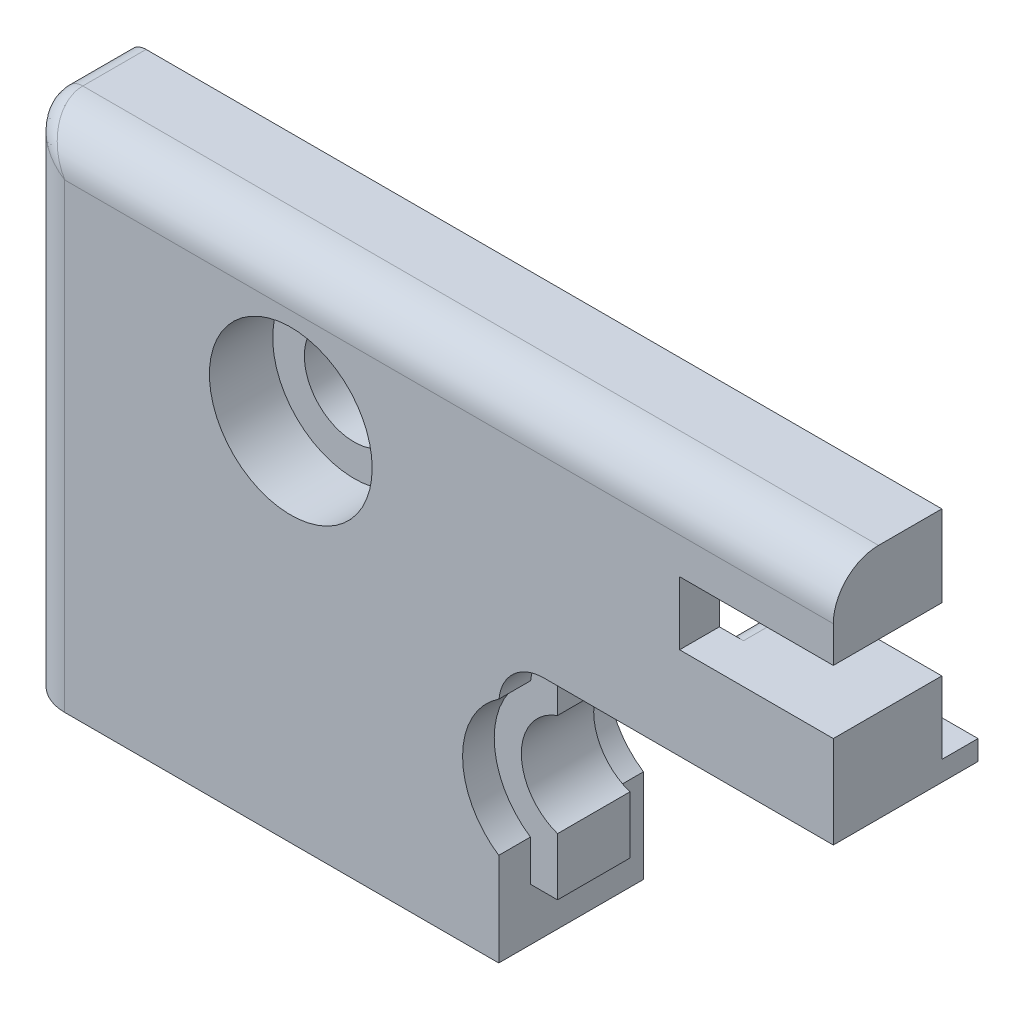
ISO-10303-21;
HEADER;
FILE_DESCRIPTION(('STEP AP214'),'2;1');
FILE_NAME('part.step','',(''),(''),'','','');
FILE_SCHEMA(('AUTOMOTIVE_DESIGN { 1 0 10303 214 1 1 1 1 }'));
ENDSEC;
DATA;
#1=APPLICATION_CONTEXT('core data for automotive mechanical design processes');
#2=APPLICATION_PROTOCOL_DEFINITION('international standard','automotive_design',2000,#1);
#3=PRODUCT_CONTEXT('',#1,'mechanical');
#4=PRODUCT('Part','Part','',(#3));
#5=PRODUCT_RELATED_PRODUCT_CATEGORY('part','',(#4));
#6=PRODUCT_DEFINITION_FORMATION('','',#4);
#7=PRODUCT_DEFINITION_CONTEXT('part definition',#1,'design');
#8=PRODUCT_DEFINITION('design','',#6,#7);
#9=PRODUCT_DEFINITION_SHAPE('','',#8);
#10=(LENGTH_UNIT() NAMED_UNIT(*) SI_UNIT(.MILLI.,.METRE.));
#11=(NAMED_UNIT(*) PLANE_ANGLE_UNIT() SI_UNIT($,.RADIAN.));
#12=(NAMED_UNIT(*) SI_UNIT($,.STERADIAN.) SOLID_ANGLE_UNIT());
#13=UNCERTAINTY_MEASURE_WITH_UNIT(LENGTH_MEASURE(1.E-05),#10,'distance_accuracy_value','');
#14=(GEOMETRIC_REPRESENTATION_CONTEXT(3) GLOBAL_UNCERTAINTY_ASSIGNED_CONTEXT((#13)) GLOBAL_UNIT_ASSIGNED_CONTEXT((#10,
#11,#12)) REPRESENTATION_CONTEXT('',''));
#15=CARTESIAN_POINT('',(0.,0.,0.));
#16=DIRECTION('',(0.,0.,1.));
#17=DIRECTION('',(1.,0.,0.));
#18=AXIS2_PLACEMENT_3D('',#15,#16,#17);
#19=CARTESIAN_POINT('',(-8.5,-1.75,8.));
#20=DIRECTION('',(0.,-1.,0.));
#21=DIRECTION('',(1.,0.,0.));
#22=AXIS2_PLACEMENT_3D('',#19,#20,#21);
#23=PLANE('',#22);
#24=DIRECTION('',(1.,0.,0.));
#25=VECTOR('',#24,1.);
#26=CARTESIAN_POINT('',(-8.5,-1.75,2.));
#27=LINE('',#26,#25);
#28=CARTESIAN_POINT('',(-7.16561914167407,-1.75,2.));
#29=VERTEX_POINT('',#28);
#30=CARTESIAN_POINT('',(0.,-1.74999999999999,2.));
#31=VERTEX_POINT('',#30);
#32=EDGE_CURVE('E318',#29,#31,#27,.T.);
#33=ORIENTED_EDGE('',*,*,#32,.F.);
#34=DIRECTION('',(0.,0.,-1.));
#35=VECTOR('',#34,1.);
#36=CARTESIAN_POINT('',(-7.16561914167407,-1.75,5.8));
#37=LINE('',#36,#35);
#38=CARTESIAN_POINT('',(-7.16561914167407,-1.75,5.8));
#39=VERTEX_POINT('',#38);
#40=EDGE_CURVE('E632',#29,#39,#37,.F.);
#41=ORIENTED_EDGE('',*,*,#40,.T.);
#42=DIRECTION('',(1.,0.,0.));
#43=VECTOR('',#42,1.);
#44=CARTESIAN_POINT('',(-8.5,-1.75,5.8));
#45=LINE('',#44,#43);
#46=CARTESIAN_POINT('',(-8.5,-1.75,5.8));
#47=VERTEX_POINT('',#46);
#48=EDGE_CURVE('E53',#47,#39,#45,.T.);
#49=ORIENTED_EDGE('',*,*,#48,.F.);
#50=DIRECTION('',(0.,0.,-1.));
#51=VECTOR('',#50,1.);
#52=CARTESIAN_POINT('',(-8.5,-1.75,8.));
#53=LINE('',#52,#51);
#54=CARTESIAN_POINT('',(-8.5,-1.75,8.));
#55=VERTEX_POINT('',#54);
#56=EDGE_CURVE('E429',#55,#47,#53,.T.);
#57=ORIENTED_EDGE('',*,*,#56,.F.);
#58=DIRECTION('',(-1.,0.,0.));
#59=VECTOR('',#58,1.);
#60=CARTESIAN_POINT('',(-8.5,-1.75,8.));
#61=LINE('',#60,#59);
#62=CARTESIAN_POINT('',(0.,-1.75,8.));
#63=VERTEX_POINT('',#62);
#64=EDGE_CURVE('E394',#63,#55,#61,.T.);
#65=ORIENTED_EDGE('',*,*,#64,.F.);
#66=DIRECTION('',(0.,0.,-1.));
#67=VECTOR('',#66,1.);
#68=CARTESIAN_POINT('',(0.,-1.75,8.));
#69=LINE('',#68,#67);
#70=EDGE_CURVE('E431',#63,#31,#69,.T.);
#71=ORIENTED_EDGE('',*,*,#70,.T.);
#72=EDGE_LOOP('',(#33,#41,#49,#57,#65,#71));
#73=FACE_BOUND('',#72,.T.);
#74=ADVANCED_FACE('F32',(#73),#23,.F.);
#75=CARTESIAN_POINT('',(-8.5,1.75,8.));
#76=DIRECTION('',(-1.,0.,0.));
#77=DIRECTION('',(0.,0.,1.));
#78=AXIS2_PLACEMENT_3D('',#75,#76,#77);
#79=PLANE('',#78);
#80=DIRECTION('',(0.,-1.,0.));
#81=VECTOR('',#80,1.);
#82=CARTESIAN_POINT('',(-8.5,1.75,5.8));
#83=LINE('',#82,#81);
#84=CARTESIAN_POINT('',(-8.5,1.75,5.8));
#85=VERTEX_POINT('',#84);
#86=EDGE_CURVE('E47',#85,#47,#83,.T.);
#87=ORIENTED_EDGE('',*,*,#86,.F.);
#88=DIRECTION('',(0.,0.,-1.));
#89=VECTOR('',#88,1.);
#90=CARTESIAN_POINT('',(-8.5,1.75,8.));
#91=LINE('',#90,#89);
#92=CARTESIAN_POINT('',(-8.5,1.75,8.));
#93=VERTEX_POINT('',#92);
#94=EDGE_CURVE('E426',#93,#85,#91,.T.);
#95=ORIENTED_EDGE('',*,*,#94,.F.);
#96=DIRECTION('',(0.,1.,0.));
#97=VECTOR('',#96,1.);
#98=CARTESIAN_POINT('',(-8.5,1.75,8.));
#99=LINE('',#98,#97);
#100=EDGE_CURVE('E396',#55,#93,#99,.T.);
#101=ORIENTED_EDGE('',*,*,#100,.F.);
#102=ORIENTED_EDGE('',*,*,#56,.T.);
#103=EDGE_LOOP('',(#87,#95,#101,#102));
#104=FACE_BOUND('',#103,.T.);
#105=ADVANCED_FACE('F520',(#104),#79,.F.);
#106=CARTESIAN_POINT('',(-16.,-9.35000000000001,0.));
#107=DIRECTION('',(0.,0.,1.));
#108=DIRECTION('',(1.,0.,0.));
#109=AXIS2_PLACEMENT_3D('',#106,#107,#108);
#110=PLANE('',#109);
#111=DIRECTION('',(-1.,0.,0.));
#112=VECTOR('',#111,1.);
#113=CARTESIAN_POINT('',(0.,-5.75000000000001,0.));
#114=LINE('',#113,#112);
#115=CARTESIAN_POINT('',(-15.7911012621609,-5.75000000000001,0.));
#116=VERTEX_POINT('',#115);
#117=CARTESIAN_POINT('',(-45.,-5.75000000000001,0.));
#118=VERTEX_POINT('',#117);
#119=EDGE_CURVE('E313',#116,#118,#114,.T.);
#120=ORIENTED_EDGE('',*,*,#119,.F.);
#121=CARTESIAN_POINT('',(-16.75,-6.0337484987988,0.));
#122=DIRECTION('',(0.,0.,1.));
#123=DIRECTION('',(1.,0.,0.));
#124=AXIS2_PLACEMENT_3D('',#121,#122,#123);
#125=CIRCLE('',#124,1.);
#126=CARTESIAN_POINT('',(-15.75,-6.0337484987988,0.));
#127=VERTEX_POINT('',#126);
#128=EDGE_CURVE('E614',#116,#127,#125,.F.);
#129=ORIENTED_EDGE('',*,*,#128,.T.);
#130=DIRECTION('',(0.,1.,0.));
#131=VECTOR('',#130,1.);
#132=CARTESIAN_POINT('',(-15.75,-9.35000000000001,0.));
#133=LINE('',#132,#131);
#134=CARTESIAN_POINT('',(-15.75,-6.85,0.));
#135=VERTEX_POINT('',#134);
#136=EDGE_CURVE('E287',#135,#127,#133,.T.);
#137=ORIENTED_EDGE('',*,*,#136,.F.);
#138=DIRECTION('',(1.,0.,0.));
#139=VECTOR('',#138,1.);
#140=CARTESIAN_POINT('',(0.,-6.85,0.));
#141=LINE('',#140,#139);
#142=CARTESIAN_POINT('',(-16.,-6.85,0.));
#143=VERTEX_POINT('',#142);
#144=EDGE_CURVE('E411',#143,#135,#141,.T.);
#145=ORIENTED_EDGE('',*,*,#144,.F.);
#146=CARTESIAN_POINT('',(-16.,-9.35000000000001,0.));
#147=DIRECTION('',(0.,0.,-1.));
#148=DIRECTION('',(1.,0.,0.));
#149=AXIS2_PLACEMENT_3D('',#146,#147,#148);
#150=CIRCLE('',#149,2.5);
#151=CARTESIAN_POINT('',(-18.4874685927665,-9.1,0.));
#152=VERTEX_POINT('',#151);
#153=EDGE_CURVE('E408',#152,#143,#150,.T.);
#154=ORIENTED_EDGE('',*,*,#153,.F.);
#155=CARTESIAN_POINT('',(-16.,-12.85,0.));
#156=DIRECTION('',(0.,0.,-1.));
#157=DIRECTION('',(-1.,0.,0.));
#158=AXIS2_PLACEMENT_3D('',#155,#156,#157);
#159=CIRCLE('',#158,4.5);
#160=CARTESIAN_POINT('',(-18.5,-16.5916573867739,0.));
#161=VERTEX_POINT('',#160);
#162=EDGE_CURVE('E333',#161,#152,#159,.T.);
#163=ORIENTED_EDGE('',*,*,#162,.F.);
#164=DIRECTION('',(0.,1.,0.));
#165=VECTOR('',#164,1.);
#166=CARTESIAN_POINT('',(-18.5,-18.85,0.));
#167=LINE('',#166,#165);
#168=CARTESIAN_POINT('',(-18.5,-21.75,0.));
#169=VERTEX_POINT('',#168);
#170=EDGE_CURVE('E406',#169,#161,#167,.T.);
#171=ORIENTED_EDGE('',*,*,#170,.F.);
#172=DIRECTION('',(1.,0.,0.));
#173=VECTOR('',#172,1.);
#174=CARTESIAN_POINT('',(-18.5,-21.75,0.));
#175=LINE('',#174,#173);
#176=CARTESIAN_POINT('',(-45.,-21.75,0.));
#177=VERTEX_POINT('',#176);
#178=EDGE_CURVE('E380',#177,#169,#175,.T.);
#179=ORIENTED_EDGE('',*,*,#178,.F.);
#180=DIRECTION('',(0.,-1.,0.));
#181=VECTOR('',#180,1.);
#182=CARTESIAN_POINT('',(-45.,-21.75,0.));
#183=LINE('',#182,#181);
#184=EDGE_CURVE('E386',#118,#177,#183,.T.);
#185=ORIENTED_EDGE('',*,*,#184,.F.);
#186=EDGE_LOOP('',(#120,#129,#137,#145,#154,#163,#171,#179,#185));
#187=FACE_BOUND('',#186,.T.);
#188=ADVANCED_FACE('F526',(#187),#110,.F.);
#189=DIRECTION('',(0.,-1.,0.));
#190=VECTOR('',#189,1.);
#191=CARTESIAN_POINT('',(-10.25,-9.35000000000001,0.));
#192=LINE('',#191,#190);
#193=CARTESIAN_POINT('',(-10.25,-6.03374849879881,0.));
#194=VERTEX_POINT('',#193);
#195=CARTESIAN_POINT('',(-10.25,-6.85000000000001,0.));
#196=VERTEX_POINT('',#195);
#197=EDGE_CURVE('E275',#194,#196,#192,.T.);
#198=ORIENTED_EDGE('',*,*,#197,.F.);
#199=CARTESIAN_POINT('',(-9.25,-6.03374849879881,0.));
#200=DIRECTION('',(0.,0.,1.));
#201=DIRECTION('',(1.,0.,0.));
#202=AXIS2_PLACEMENT_3D('',#199,#200,#201);
#203=CIRCLE('',#202,1.);
#204=CARTESIAN_POINT('',(-10.2088987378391,-5.75000000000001,0.));
#205=VERTEX_POINT('',#204);
#206=EDGE_CURVE('E624',#194,#205,#203,.F.);
#207=ORIENTED_EDGE('',*,*,#206,.T.);
#208=CARTESIAN_POINT('',(0.,-5.75000000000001,0.));
#209=VERTEX_POINT('',#208);
#210=EDGE_CURVE('E310',#209,#205,#114,.T.);
#211=ORIENTED_EDGE('',*,*,#210,.F.);
#212=DIRECTION('',(0.,1.,0.));
#213=VECTOR('',#212,1.);
#214=CARTESIAN_POINT('',(0.,-1.75,0.));
#215=LINE('',#214,#213);
#216=CARTESIAN_POINT('',(0.,-6.85,0.));
#217=VERTEX_POINT('',#216);
#218=EDGE_CURVE('E413',#217,#209,#215,.T.);
#219=ORIENTED_EDGE('',*,*,#218,.F.);
#220=EDGE_CURVE('E410',#196,#217,#141,.T.);
#221=ORIENTED_EDGE('',*,*,#220,.F.);
#222=EDGE_LOOP('',(#198,#207,#211,#219,#221));
#223=FACE_BOUND('',#222,.T.);
#224=ADVANCED_FACE('F540',(#223),#110,.F.);
#225=CARTESIAN_POINT('',(0.,-6.85,8.));
#226=DIRECTION('',(0.,1.,0.));
#227=DIRECTION('',(-1.,0.,0.));
#228=AXIS2_PLACEMENT_3D('',#225,#226,#227);
#229=PLANE('',#228);
#230=DIRECTION('',(0.,0.,1.));
#231=VECTOR('',#230,1.);
#232=CARTESIAN_POINT('',(-15.75,-6.85,-1.5));
#233=LINE('',#232,#231);
#234=CARTESIAN_POINT('',(-15.75,-6.85,5.8));
#235=VERTEX_POINT('',#234);
#236=EDGE_CURVE('E278',#135,#235,#233,.T.);
#237=ORIENTED_EDGE('',*,*,#236,.T.);
#238=DIRECTION('',(-1.,0.,0.));
#239=VECTOR('',#238,1.);
#240=CARTESIAN_POINT('',(-15.75,-6.85,5.8));
#241=LINE('',#240,#239);
#242=CARTESIAN_POINT('',(-10.25,-6.85000000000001,5.8));
#243=VERTEX_POINT('',#242);
#244=EDGE_CURVE('E263',#243,#235,#241,.T.);
#245=ORIENTED_EDGE('',*,*,#244,.F.);
#246=DIRECTION('',(0.,0.,1.));
#247=VECTOR('',#246,1.);
#248=CARTESIAN_POINT('',(-10.25,-6.85000000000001,-1.5));
#249=LINE('',#248,#247);
#250=EDGE_CURVE('E272',#196,#243,#249,.T.);
#251=ORIENTED_EDGE('',*,*,#250,.F.);
#252=ORIENTED_EDGE('',*,*,#220,.T.);
#253=DIRECTION('',(0.,0.,-1.));
#254=VECTOR('',#253,1.);
#255=CARTESIAN_POINT('',(0.,-6.85,8.));
#256=LINE('',#255,#254);
#257=CARTESIAN_POINT('',(0.,-6.85,8.));
#258=VERTEX_POINT('',#257);
#259=EDGE_CURVE('E434',#258,#217,#256,.T.);
#260=ORIENTED_EDGE('',*,*,#259,.F.);
#261=DIRECTION('',(1.,0.,0.));
#262=VECTOR('',#261,1.);
#263=CARTESIAN_POINT('',(0.,-6.85,8.));
#264=LINE('',#263,#262);
#265=CARTESIAN_POINT('',(-16.,-6.85,8.));
#266=VERTEX_POINT('',#265);
#267=EDGE_CURVE('E390',#266,#258,#264,.T.);
#268=ORIENTED_EDGE('',*,*,#267,.F.);
#269=DIRECTION('',(0.,0.,-1.));
#270=VECTOR('',#269,1.);
#271=CARTESIAN_POINT('',(-16.,-6.85,8.));
#272=LINE('',#271,#270);
#273=EDGE_CURVE('E437',#266,#143,#272,.T.);
#274=ORIENTED_EDGE('',*,*,#273,.T.);
#275=ORIENTED_EDGE('',*,*,#144,.T.);
#276=EDGE_LOOP('',(#237,#245,#251,#252,#260,#268,#274,#275));
#277=FACE_BOUND('',#276,.T.);
#278=ADVANCED_FACE('F280',(#277),#229,.F.);
#279=CARTESIAN_POINT('',(0.,-30.0864940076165,2.));
#280=DIRECTION('',(0.,0.,-1.));
#281=DIRECTION('',(0.,1.,0.));
#282=AXIS2_PLACEMENT_3D('',#279,#280,#281);
#283=PLANE('',#282);
#284=CARTESIAN_POINT('',(-30.,-1.55,2.));
#285=DIRECTION('',(0.,0.,-1.));
#286=DIRECTION('',(0.,1.,0.));
#287=AXIS2_PLACEMENT_3D('',#284,#285,#286);
#288=CIRCLE('',#287,2.75);
#289=CARTESIAN_POINT('',(-30.,1.2,2.));
#290=VERTEX_POINT('',#289);
#291=EDGE_CURVE('E320',#290,#290,#288,.T.);
#292=ORIENTED_EDGE('',*,*,#291,.F.);
#293=EDGE_LOOP('',(#292));
#294=FACE_BOUND('',#293,.T.);
#295=CARTESIAN_POINT('',(-13.,-1.35000000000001,2.));
#296=DIRECTION('',(0.,0.,-1.));
#297=DIRECTION('',(0.,1.,0.));
#298=AXIS2_PLACEMENT_3D('',#295,#296,#297);
#299=CIRCLE('',#298,5.);
#300=CARTESIAN_POINT('',(-9.34444904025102,2.06129699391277,2.));
#301=VERTEX_POINT('',#300);
#302=CARTESIAN_POINT('',(-16.125,-5.25312374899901,2.));
#303=VERTEX_POINT('',#302);
#304=EDGE_CURVE('E661',#301,#303,#299,.F.);
#305=ORIENTED_EDGE('',*,*,#304,.T.);
#306=CARTESIAN_POINT('',(-16.75,-6.0337484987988,2.));
#307=DIRECTION('',(0.,0.,-1.));
#308=DIRECTION('',(0.,1.,0.));
#309=AXIS2_PLACEMENT_3D('',#306,#307,#308);
#310=CIRCLE('',#309,1.);
#311=CARTESIAN_POINT('',(-15.7911012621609,-5.75000000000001,2.));
#312=VERTEX_POINT('',#311);
#313=EDGE_CURVE('E605',#303,#312,#310,.T.);
#314=ORIENTED_EDGE('',*,*,#313,.T.);
#315=DIRECTION('',(-1.,0.,0.));
#316=VECTOR('',#315,1.);
#317=CARTESIAN_POINT('',(0.,-5.75000000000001,2.));
#318=LINE('',#317,#316);
#319=CARTESIAN_POINT('',(-45.,-5.75000000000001,2.));
#320=VERTEX_POINT('',#319);
#321=EDGE_CURVE('E309',#312,#320,#318,.T.);
#322=ORIENTED_EDGE('',*,*,#321,.T.);
#323=DIRECTION('',(0.,-1.,0.));
#324=VECTOR('',#323,1.);
#325=CARTESIAN_POINT('',(-45.,-30.0864940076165,2.));
#326=LINE('',#325,#324);
#327=CARTESIAN_POINT('',(-45.,5.24999999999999,2.));
#328=VERTEX_POINT('',#327);
#329=EDGE_CURVE('E292',#328,#320,#326,.T.);
#330=ORIENTED_EDGE('',*,*,#329,.F.);
#331=CARTESIAN_POINT('',(-44.,5.24999999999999,2.));
#332=DIRECTION('',(0.,0.,-1.));
#333=DIRECTION('',(0.,1.,0.));
#334=AXIS2_PLACEMENT_3D('',#331,#332,#333);
#335=CIRCLE('',#334,1.);
#336=CARTESIAN_POINT('',(-44.,6.24999999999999,2.));
#337=VERTEX_POINT('',#336);
#338=EDGE_CURVE('E479',#337,#328,#335,.F.);
#339=ORIENTED_EDGE('',*,*,#338,.F.);
#340=DIRECTION('',(-1.,0.,0.));
#341=VECTOR('',#340,1.);
#342=CARTESIAN_POINT('',(0.,6.24999999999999,2.));
#343=LINE('',#342,#341);
#344=CARTESIAN_POINT('',(0.,6.24999999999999,2.));
#345=VERTEX_POINT('',#344);
#346=EDGE_CURVE('E299',#345,#337,#343,.T.);
#347=ORIENTED_EDGE('',*,*,#346,.F.);
#348=DIRECTION('',(0.,-1.,0.));
#349=VECTOR('',#348,1.);
#350=CARTESIAN_POINT('',(0.,-30.0864940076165,2.));
#351=LINE('',#350,#349);
#352=CARTESIAN_POINT('',(0.,1.74999999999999,2.));
#353=VERTEX_POINT('',#352);
#354=EDGE_CURVE('E293',#345,#353,#351,.T.);
#355=ORIENTED_EDGE('',*,*,#354,.T.);
#356=DIRECTION('',(-1.,0.,0.));
#357=VECTOR('',#356,1.);
#358=CARTESIAN_POINT('',(0.,1.75,2.));
#359=LINE('',#358,#357);
#360=CARTESIAN_POINT('',(-8.5,1.75,2.));
#361=VERTEX_POINT('',#360);
#362=EDGE_CURVE('E308',#353,#361,#359,.T.);
#363=ORIENTED_EDGE('',*,*,#362,.T.);
#364=CARTESIAN_POINT('',(-8.61333884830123,2.74355639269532,2.));
#365=DIRECTION('',(0.,0.,-1.));
#366=DIRECTION('',(0.,1.,0.));
#367=AXIS2_PLACEMENT_3D('',#364,#365,#366);
#368=CIRCLE('',#367,1.);
#369=EDGE_CURVE('E600',#361,#301,#368,.T.);
#370=ORIENTED_EDGE('',*,*,#369,.T.);
#371=EDGE_LOOP('',(#305,#314,#322,#330,#339,#347,#355,#363,#370));
#372=FACE_BOUND('',#371,.T.);
#373=ADVANCED_FACE('F539',(#294,#372),#283,.T.);
#374=CARTESIAN_POINT('',(0.,-5.75000000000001,2.));
#375=VERTEX_POINT('',#374);
#376=CARTESIAN_POINT('',(-10.2088987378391,-5.75000000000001,2.));
#377=VERTEX_POINT('',#376);
#378=EDGE_CURVE('E305',#375,#377,#318,.T.);
#379=ORIENTED_EDGE('',*,*,#378,.T.);
#380=CARTESIAN_POINT('',(-9.25,-6.03374849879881,2.));
#381=DIRECTION('',(0.,0.,-1.));
#382=DIRECTION('',(0.,1.,0.));
#383=AXIS2_PLACEMENT_3D('',#380,#381,#382);
#384=CIRCLE('',#383,1.);
#385=CARTESIAN_POINT('',(-9.875,-5.25312374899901,2.));
#386=VERTEX_POINT('',#385);
#387=EDGE_CURVE('E630',#377,#386,#384,.T.);
#388=ORIENTED_EDGE('',*,*,#387,.T.);
#389=CARTESIAN_POINT('',(-8.13801595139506,-2.51666666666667,2.));
#390=VERTEX_POINT('',#389);
#391=EDGE_CURVE('E649',#386,#390,#299,.F.);
#392=ORIENTED_EDGE('',*,*,#391,.T.);
#393=CARTESIAN_POINT('',(-7.16561914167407,-2.75,2.));
#394=DIRECTION('',(0.,0.,-1.));
#395=DIRECTION('',(0.,1.,0.));
#396=AXIS2_PLACEMENT_3D('',#393,#394,#395);
#397=CIRCLE('',#396,1.);
#398=EDGE_CURVE('E628',#390,#29,#397,.T.);
#399=ORIENTED_EDGE('',*,*,#398,.T.);
#400=ORIENTED_EDGE('',*,*,#32,.T.);
#401=EDGE_CURVE('E296',#31,#375,#351,.T.);
#402=ORIENTED_EDGE('',*,*,#401,.T.);
#403=EDGE_LOOP('',(#379,#388,#392,#399,#400,#402));
#404=FACE_BOUND('',#403,.T.);
#405=ADVANCED_FACE('F647',(#404),#283,.T.);
#406=CARTESIAN_POINT('',(0.,-5.75000000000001,2.75));
#407=DIRECTION('',(0.,-1.,0.));
#408=DIRECTION('',(0.,0.,-1.));
#409=AXIS2_PLACEMENT_3D('',#406,#407,#408);
#410=PLANE('',#409);
#411=ORIENTED_EDGE('',*,*,#321,.F.);
#412=DIRECTION('',(0.,0.,1.));
#413=VECTOR('',#412,1.);
#414=CARTESIAN_POINT('',(-15.7911012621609,-5.75000000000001,2.));
#415=LINE('',#414,#413);
#416=EDGE_CURVE('E608',#312,#116,#415,.F.);
#417=ORIENTED_EDGE('',*,*,#416,.T.);
#418=ORIENTED_EDGE('',*,*,#119,.T.);
#419=DIRECTION('',(0.,0.,1.));
#420=VECTOR('',#419,1.);
#421=CARTESIAN_POINT('',(-45.,-5.75000000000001,2.75));
#422=LINE('',#421,#420);
#423=EDGE_CURVE('E302',#118,#320,#422,.T.);
#424=ORIENTED_EDGE('',*,*,#423,.T.);
#425=EDGE_LOOP('',(#411,#417,#418,#424));
#426=FACE_BOUND('',#425,.T.);
#427=ADVANCED_FACE('F681',(#426),#410,.F.);
#428=ORIENTED_EDGE('',*,*,#210,.T.);
#429=DIRECTION('',(0.,0.,1.));
#430=VECTOR('',#429,1.);
#431=CARTESIAN_POINT('',(-10.2088987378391,-5.75000000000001,0.));
#432=LINE('',#431,#430);
#433=EDGE_CURVE('E626',#205,#377,#432,.T.);
#434=ORIENTED_EDGE('',*,*,#433,.T.);
#435=ORIENTED_EDGE('',*,*,#378,.F.);
#436=DIRECTION('',(0.,0.,1.));
#437=VECTOR('',#436,1.);
#438=CARTESIAN_POINT('',(0.,-5.75000000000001,2.75));
#439=LINE('',#438,#437);
#440=EDGE_CURVE('E295',#209,#375,#439,.T.);
#441=ORIENTED_EDGE('',*,*,#440,.F.);
#442=EDGE_LOOP('',(#428,#434,#435,#441));
#443=FACE_BOUND('',#442,.T.);
#444=ADVANCED_FACE('F657',(#443),#410,.F.);
#445=CARTESIAN_POINT('',(-30.,-1.55,8.));
#446=DIRECTION('',(0.,0.,-1.));
#447=DIRECTION('',(-1.,0.,0.));
#448=AXIS2_PLACEMENT_3D('',#445,#446,#447);
#449=CYLINDRICAL_SURFACE('',#448,2.75);
#450=CARTESIAN_POINT('',(-30.,-1.55,4.5));
#451=DIRECTION('',(0.,0.,1.));
#452=DIRECTION('',(1.,0.,0.));
#453=AXIS2_PLACEMENT_3D('',#450,#451,#452);
#454=CIRCLE('',#453,2.75);
#455=CARTESIAN_POINT('',(-27.25,-1.55,4.5));
#456=VERTEX_POINT('',#455);
#457=EDGE_CURVE('E327',#456,#456,#454,.T.);
#458=ORIENTED_EDGE('',*,*,#457,.T.);
#459=EDGE_LOOP('',(#458));
#460=FACE_BOUND('',#459,.T.);
#461=ORIENTED_EDGE('',*,*,#291,.T.);
#462=EDGE_LOOP('',(#461));
#463=FACE_BOUND('',#462,.T.);
#464=ADVANCED_FACE('F535',(#460,#463),#449,.F.);
#465=CARTESIAN_POINT('',(0.,-1.75,8.));
#466=DIRECTION('',(-1.,0.,0.));
#467=DIRECTION('',(0.,0.,1.));
#468=AXIS2_PLACEMENT_3D('',#465,#466,#467);
#469=PLANE('',#468);
#470=ORIENTED_EDGE('',*,*,#401,.F.);
#471=ORIENTED_EDGE('',*,*,#70,.F.);
#472=DIRECTION('',(0.,1.,0.));
#473=VECTOR('',#472,1.);
#474=CARTESIAN_POINT('',(0.,-1.75,8.));
#475=LINE('',#474,#473);
#476=EDGE_CURVE('E392',#258,#63,#475,.T.);
#477=ORIENTED_EDGE('',*,*,#476,.F.);
#478=ORIENTED_EDGE('',*,*,#259,.T.);
#479=ORIENTED_EDGE('',*,*,#218,.T.);
#480=ORIENTED_EDGE('',*,*,#440,.T.);
#481=EDGE_LOOP('',(#470,#471,#477,#478,#479,#480));
#482=FACE_BOUND('',#481,.T.);
#483=ADVANCED_FACE('F531',(#482),#469,.F.);
#484=CARTESIAN_POINT('',(0.,1.75,8.));
#485=DIRECTION('',(0.,1.,0.));
#486=DIRECTION('',(0.,0.,1.));
#487=AXIS2_PLACEMENT_3D('',#484,#485,#486);
#488=PLANE('',#487);
#489=ORIENTED_EDGE('',*,*,#362,.F.);
#490=DIRECTION('',(0.,0.,-1.));
#491=VECTOR('',#490,1.);
#492=CARTESIAN_POINT('',(0.,1.75,8.));
#493=LINE('',#492,#491);
#494=CARTESIAN_POINT('',(0.,1.75,8.));
#495=VERTEX_POINT('',#494);
#496=EDGE_CURVE('E422',#495,#353,#493,.T.);
#497=ORIENTED_EDGE('',*,*,#496,.F.);
#498=DIRECTION('',(1.,0.,0.));
#499=VECTOR('',#498,1.);
#500=CARTESIAN_POINT('',(0.,1.75,8.));
#501=LINE('',#500,#499);
#502=EDGE_CURVE('E398',#93,#495,#501,.T.);
#503=ORIENTED_EDGE('',*,*,#502,.F.);
#504=ORIENTED_EDGE('',*,*,#94,.T.);
#505=EDGE_CURVE('E425',#85,#361,#91,.T.);
#506=ORIENTED_EDGE('',*,*,#505,.T.);
#507=EDGE_LOOP('',(#489,#497,#503,#504,#506));
#508=FACE_BOUND('',#507,.T.);
#509=ADVANCED_FACE('F534',(#508),#488,.F.);
#510=CARTESIAN_POINT('',(0.,6.25,8.));
#511=DIRECTION('',(-1.,0.,0.));
#512=DIRECTION('',(0.,0.,1.));
#513=AXIS2_PLACEMENT_3D('',#510,#511,#512);
#514=PLANE('',#513);
#515=ORIENTED_EDGE('',*,*,#354,.F.);
#516=DIRECTION('',(0.,0.,-1.));
#517=VECTOR('',#516,1.);
#518=CARTESIAN_POINT('',(0.,6.25,8.));
#519=LINE('',#518,#517);
#520=CARTESIAN_POINT('',(0.,6.25,5.5));
#521=VERTEX_POINT('',#520);
#522=EDGE_CURVE('E419',#521,#345,#519,.T.);
#523=ORIENTED_EDGE('',*,*,#522,.F.);
#524=CARTESIAN_POINT('',(0.,3.75,5.5));
#525=DIRECTION('',(-1.,0.,0.));
#526=DIRECTION('',(0.,0.,1.));
#527=AXIS2_PLACEMENT_3D('',#524,#525,#526);
#528=CIRCLE('',#527,2.5);
#529=CARTESIAN_POINT('',(0.,3.75,8.));
#530=VERTEX_POINT('',#529);
#531=EDGE_CURVE('E470',#521,#530,#528,.F.);
#532=ORIENTED_EDGE('',*,*,#531,.T.);
#533=DIRECTION('',(0.,1.,0.));
#534=VECTOR('',#533,1.);
#535=CARTESIAN_POINT('',(0.,6.25,8.));
#536=LINE('',#535,#534);
#537=EDGE_CURVE('E400',#495,#530,#536,.T.);
#538=ORIENTED_EDGE('',*,*,#537,.F.);
#539=ORIENTED_EDGE('',*,*,#496,.T.);
#540=EDGE_LOOP('',(#515,#523,#532,#538,#539));
#541=FACE_BOUND('',#540,.T.);
#542=ADVANCED_FACE('F592',(#541),#514,.F.);
#543=CARTESIAN_POINT('',(-45.,6.25,8.));
#544=DIRECTION('',(0.,-1.,0.));
#545=DIRECTION('',(1.,0.,0.));
#546=AXIS2_PLACEMENT_3D('',#543,#544,#545);
#547=PLANE('',#546);
#548=ORIENTED_EDGE('',*,*,#346,.T.);
#549=DIRECTION('',(0.,0.,-1.));
#550=VECTOR('',#549,1.);
#551=CARTESIAN_POINT('',(-44.,6.25,8.));
#552=LINE('',#551,#550);
#553=CARTESIAN_POINT('',(-44.,6.25,5.5));
#554=VERTEX_POINT('',#553);
#555=EDGE_CURVE('E461',#337,#554,#552,.F.);
#556=ORIENTED_EDGE('',*,*,#555,.T.);
#557=DIRECTION('',(-1.,0.,0.));
#558=VECTOR('',#557,1.);
#559=CARTESIAN_POINT('',(0.,6.25,5.5));
#560=LINE('',#559,#558);
#561=EDGE_CURVE('E468',#554,#521,#560,.F.);
#562=ORIENTED_EDGE('',*,*,#561,.T.);
#563=ORIENTED_EDGE('',*,*,#522,.T.);
#564=EDGE_LOOP('',(#548,#556,#562,#563));
#565=FACE_BOUND('',#564,.T.);
#566=ADVANCED_FACE('F577',(#565),#547,.F.);
#567=CARTESIAN_POINT('',(-45.,-21.75,8.));
#568=DIRECTION('',(1.,0.,0.));
#569=DIRECTION('',(0.,0.,-1.));
#570=AXIS2_PLACEMENT_3D('',#567,#568,#569);
#571=PLANE('',#570);
#572=ORIENTED_EDGE('',*,*,#329,.T.);
#573=ORIENTED_EDGE('',*,*,#423,.F.);
#574=ORIENTED_EDGE('',*,*,#184,.T.);
#575=DIRECTION('',(0.,0.,-1.));
#576=VECTOR('',#575,1.);
#577=CARTESIAN_POINT('',(-45.,-21.75,8.));
#578=LINE('',#577,#576);
#579=CARTESIAN_POINT('',(-45.,-21.75,5.5));
#580=VERTEX_POINT('',#579);
#581=EDGE_CURVE('E403',#580,#177,#578,.T.);
#582=ORIENTED_EDGE('',*,*,#581,.F.);
#583=DIRECTION('',(0.,-1.,0.));
#584=VECTOR('',#583,1.);
#585=CARTESIAN_POINT('',(-45.,5.24999999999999,5.5));
#586=LINE('',#585,#584);
#587=CARTESIAN_POINT('',(-45.,5.24999999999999,5.5));
#588=VERTEX_POINT('',#587);
#589=EDGE_CURVE('E477',#580,#588,#586,.F.);
#590=ORIENTED_EDGE('',*,*,#589,.T.);
#591=DIRECTION('',(0.,0.,-1.));
#592=VECTOR('',#591,1.);
#593=CARTESIAN_POINT('',(-45.,5.24999999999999,8.));
#594=LINE('',#593,#592);
#595=EDGE_CURVE('E458',#588,#328,#594,.T.);
#596=ORIENTED_EDGE('',*,*,#595,.T.);
#597=EDGE_LOOP('',(#572,#573,#574,#582,#590,#596));
#598=FACE_BOUND('',#597,.T.);
#599=ADVANCED_FACE('F572',(#598),#571,.F.);
#600=CARTESIAN_POINT('',(-44.,5.24999999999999,8.));
#601=DIRECTION('',(0.,0.,-1.));
#602=DIRECTION('',(-1.,0.,0.));
#603=AXIS2_PLACEMENT_3D('',#600,#601,#602);
#604=CYLINDRICAL_SURFACE('',#603,1.);
#605=ORIENTED_EDGE('',*,*,#555,.F.);
#606=ORIENTED_EDGE('',*,*,#338,.T.);
#607=ORIENTED_EDGE('',*,*,#595,.F.);
#608=CARTESIAN_POINT('',(-44.,5.24999999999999,5.5));
#609=DIRECTION('',(0.,0.,-1.));
#610=DIRECTION('',(-1.,0.,0.));
#611=AXIS2_PLACEMENT_3D('',#608,#609,#610);
#612=CIRCLE('',#611,1.);
#613=EDGE_CURVE('E472',#588,#554,#612,.T.);
#614=ORIENTED_EDGE('',*,*,#613,.T.);
#615=EDGE_LOOP('',(#605,#606,#607,#614));
#616=FACE_BOUND('',#615,.T.);
#617=ADVANCED_FACE('F563',(#616),#604,.T.);
#618=CARTESIAN_POINT('',(-17.,-18.85,8.));
#619=DIRECTION('',(0.,1.,0.));
#620=DIRECTION('',(0.,0.,1.));
#621=AXIS2_PLACEMENT_3D('',#618,#619,#620);
#622=PLANE('',#621);
#623=DIRECTION('',(-1.,0.,0.));
#624=VECTOR('',#623,1.);
#625=CARTESIAN_POINT('',(-17.,-18.85,2.25));
#626=LINE('',#625,#624);
#627=CARTESIAN_POINT('',(-17.,-18.85,2.25));
#628=VERTEX_POINT('',#627);
#629=CARTESIAN_POINT('',(-18.5,-18.85,2.25));
#630=VERTEX_POINT('',#629);
#631=EDGE_CURVE('E335',#628,#630,#626,.T.);
#632=ORIENTED_EDGE('',*,*,#631,.F.);
#633=DIRECTION('',(0.,0.,-1.));
#634=VECTOR('',#633,1.);
#635=CARTESIAN_POINT('',(-17.,-18.85,8.));
#636=LINE('',#635,#634);
#637=CARTESIAN_POINT('',(-17.,-18.85,6.25));
#638=VERTEX_POINT('',#637);
#639=EDGE_CURVE('E449',#638,#628,#636,.T.);
#640=ORIENTED_EDGE('',*,*,#639,.F.);
#641=DIRECTION('',(1.,0.,0.));
#642=VECTOR('',#641,1.);
#643=CARTESIAN_POINT('',(-29.4750790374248,-18.85,6.25));
#644=LINE('',#643,#642);
#645=CARTESIAN_POINT('',(-18.5,-18.85,6.25));
#646=VERTEX_POINT('',#645);
#647=EDGE_CURVE('E368',#646,#638,#644,.T.);
#648=ORIENTED_EDGE('',*,*,#647,.F.);
#649=DIRECTION('',(0.,0.,-1.));
#650=VECTOR('',#649,1.);
#651=CARTESIAN_POINT('',(-18.5,-18.85,8.));
#652=LINE('',#651,#650);
#653=EDGE_CURVE('E452',#646,#630,#652,.T.);
#654=ORIENTED_EDGE('',*,*,#653,.T.);
#655=EDGE_LOOP('',(#632,#640,#648,#654));
#656=FACE_BOUND('',#655,.T.);
#657=ADVANCED_FACE('F559',(#656),#622,.F.);
#658=CARTESIAN_POINT('',(-17.,-15.6784271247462,8.));
#659=DIRECTION('',(-1.,0.,0.));
#660=DIRECTION('',(0.,0.,1.));
#661=AXIS2_PLACEMENT_3D('',#658,#659,#660);
#662=PLANE('',#661);
#663=DIRECTION('',(0.,-1.,0.));
#664=VECTOR('',#663,1.);
#665=CARTESIAN_POINT('',(-17.,-15.6784271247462,2.25));
#666=LINE('',#665,#664);
#667=CARTESIAN_POINT('',(-17.,-15.6784271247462,2.25));
#668=VERTEX_POINT('',#667);
#669=EDGE_CURVE('E332',#668,#628,#666,.T.);
#670=ORIENTED_EDGE('',*,*,#669,.F.);
#671=DIRECTION('',(0.,0.,-1.));
#672=VECTOR('',#671,1.);
#673=CARTESIAN_POINT('',(-17.,-15.6784271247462,8.));
#674=LINE('',#673,#672);
#675=CARTESIAN_POINT('',(-17.,-15.6784271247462,6.25));
#676=VERTEX_POINT('',#675);
#677=EDGE_CURVE('E446',#676,#668,#674,.T.);
#678=ORIENTED_EDGE('',*,*,#677,.F.);
#679=DIRECTION('',(0.,1.,0.));
#680=VECTOR('',#679,1.);
#681=CARTESIAN_POINT('',(-17.,-54.3676167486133,6.25));
#682=LINE('',#681,#680);
#683=EDGE_CURVE('E370',#638,#676,#682,.T.);
#684=ORIENTED_EDGE('',*,*,#683,.F.);
#685=ORIENTED_EDGE('',*,*,#639,.T.);
#686=EDGE_LOOP('',(#670,#678,#684,#685));
#687=FACE_BOUND('',#686,.T.);
#688=ADVANCED_FACE('F555',(#687),#662,.F.);
#689=CARTESIAN_POINT('',(-16.,-12.85,8.));
#690=DIRECTION('',(0.,0.,-1.));
#691=DIRECTION('',(-1.,0.,0.));
#692=AXIS2_PLACEMENT_3D('',#689,#690,#691);
#693=CYLINDRICAL_SURFACE('',#692,3.);
#694=CARTESIAN_POINT('',(-16.,-12.85,2.25));
#695=DIRECTION('',(0.,0.,1.));
#696=DIRECTION('',(-1.,0.,0.));
#697=AXIS2_PLACEMENT_3D('',#694,#695,#696);
#698=CIRCLE('',#697,3.);
#699=CARTESIAN_POINT('',(-17.,-10.0215728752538,2.25));
#700=VERTEX_POINT('',#699);
#701=EDGE_CURVE('E330',#700,#668,#698,.T.);
#702=ORIENTED_EDGE('',*,*,#701,.F.);
#703=DIRECTION('',(0.,0.,-1.));
#704=VECTOR('',#703,1.);
#705=CARTESIAN_POINT('',(-17.,-10.0215728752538,8.));
#706=LINE('',#705,#704);
#707=CARTESIAN_POINT('',(-17.,-10.0215728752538,6.25));
#708=VERTEX_POINT('',#707);
#709=EDGE_CURVE('E443',#708,#700,#706,.T.);
#710=ORIENTED_EDGE('',*,*,#709,.F.);
#711=CARTESIAN_POINT('',(-16.,-12.85,6.25));
#712=DIRECTION('',(0.,0.,1.));
#713=DIRECTION('',(1.,0.,0.));
#714=AXIS2_PLACEMENT_3D('',#711,#712,#713);
#715=CIRCLE('',#714,3.);
#716=EDGE_CURVE('E372',#676,#708,#715,.F.);
#717=ORIENTED_EDGE('',*,*,#716,.F.);
#718=ORIENTED_EDGE('',*,*,#677,.T.);
#719=EDGE_LOOP('',(#702,#710,#717,#718));
#720=FACE_BOUND('',#719,.T.);
#721=ADVANCED_FACE('F551',(#720),#693,.F.);
#722=CARTESIAN_POINT('',(-17.,-7.05871215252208,8.));
#723=DIRECTION('',(-1.,0.,0.));
#724=DIRECTION('',(0.,-1.,0.));
#725=AXIS2_PLACEMENT_3D('',#722,#723,#724);
#726=PLANE('',#725);
#727=DIRECTION('',(0.,-1.,0.));
#728=VECTOR('',#727,1.);
#729=CARTESIAN_POINT('',(-17.,-7.05871215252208,2.25));
#730=LINE('',#729,#728);
#731=CARTESIAN_POINT('',(-17.,-7.05871215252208,2.25));
#732=VERTEX_POINT('',#731);
#733=EDGE_CURVE('E346',#732,#700,#730,.T.);
#734=ORIENTED_EDGE('',*,*,#733,.F.);
#735=DIRECTION('',(0.,0.,-1.));
#736=VECTOR('',#735,1.);
#737=CARTESIAN_POINT('',(-17.,-7.05871215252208,8.));
#738=LINE('',#737,#736);
#739=CARTESIAN_POINT('',(-17.,-7.05871215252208,6.25));
#740=VERTEX_POINT('',#739);
#741=EDGE_CURVE('E440',#740,#732,#738,.T.);
#742=ORIENTED_EDGE('',*,*,#741,.F.);
#743=DIRECTION('',(0.,1.,0.));
#744=VECTOR('',#743,1.);
#745=CARTESIAN_POINT('',(-16.9999999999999,-54.3676167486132,6.25));
#746=LINE('',#745,#744);
#747=EDGE_CURVE('E358',#708,#740,#746,.T.);
#748=ORIENTED_EDGE('',*,*,#747,.F.);
#749=ORIENTED_EDGE('',*,*,#709,.T.);
#750=EDGE_LOOP('',(#734,#742,#748,#749));
#751=FACE_BOUND('',#750,.T.);
#752=ADVANCED_FACE('F547',(#751),#726,.F.);
#753=CARTESIAN_POINT('',(-16.,-9.35000000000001,8.));
#754=DIRECTION('',(0.,0.,1.));
#755=DIRECTION('',(1.,0.,0.));
#756=AXIS2_PLACEMENT_3D('',#753,#754,#755);
#757=PLANE('',#756);
#758=CARTESIAN_POINT('',(-30.,-1.55,8.));
#759=DIRECTION('',(0.,0.,1.));
#760=DIRECTION('',(1.,0.,0.));
#761=AXIS2_PLACEMENT_3D('',#758,#759,#760);
#762=CIRCLE('',#761,4.5);
#763=CARTESIAN_POINT('',(-25.5,-1.55,8.));
#764=VERTEX_POINT('',#763);
#765=EDGE_CURVE('E323',#764,#764,#762,.T.);
#766=ORIENTED_EDGE('',*,*,#765,.F.);
#767=EDGE_LOOP('',(#766));
#768=FACE_BOUND('',#767,.T.);
#769=ORIENTED_EDGE('',*,*,#537,.T.);
#770=DIRECTION('',(-1.,0.,0.));
#771=VECTOR('',#770,1.);
#772=CARTESIAN_POINT('',(-44.,3.75,8.));
#773=LINE('',#772,#771);
#774=CARTESIAN_POINT('',(-42.5,3.75,8.));
#775=VERTEX_POINT('',#774);
#776=EDGE_CURVE('E465',#530,#775,#773,.T.);
#777=ORIENTED_EDGE('',*,*,#776,.T.);
#778=DIRECTION('',(0.,-1.,0.));
#779=VECTOR('',#778,1.);
#780=CARTESIAN_POINT('',(-42.5,-21.75,8.));
#781=LINE('',#780,#779);
#782=CARTESIAN_POINT('',(-42.5,-21.75,8.));
#783=VERTEX_POINT('',#782);
#784=EDGE_CURVE('E463',#775,#783,#781,.T.);
#785=ORIENTED_EDGE('',*,*,#784,.T.);
#786=DIRECTION('',(1.,0.,0.));
#787=VECTOR('',#786,1.);
#788=CARTESIAN_POINT('',(-18.5,-21.75,8.));
#789=LINE('',#788,#787);
#790=CARTESIAN_POINT('',(-18.5,-21.75,8.));
#791=VERTEX_POINT('',#790);
#792=EDGE_CURVE('E383',#783,#791,#789,.T.);
#793=ORIENTED_EDGE('',*,*,#792,.T.);
#794=DIRECTION('',(0.,1.,0.));
#795=VECTOR('',#794,1.);
#796=CARTESIAN_POINT('',(-18.5,-18.85,8.));
#797=LINE('',#796,#795);
#798=CARTESIAN_POINT('',(-18.5,-16.5916573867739,8.));
#799=VERTEX_POINT('',#798);
#800=EDGE_CURVE('E385',#791,#799,#797,.T.);
#801=ORIENTED_EDGE('',*,*,#800,.T.);
#802=CARTESIAN_POINT('',(-16.,-12.85,8.));
#803=DIRECTION('',(0.,0.,1.));
#804=DIRECTION('',(1.,0.,0.));
#805=AXIS2_PLACEMENT_3D('',#802,#803,#804);
#806=CIRCLE('',#805,4.5);
#807=CARTESIAN_POINT('',(-18.4874685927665,-9.1,8.));
#808=VERTEX_POINT('',#807);
#809=EDGE_CURVE('E355',#808,#799,#806,.T.);
#810=ORIENTED_EDGE('',*,*,#809,.F.);
#811=CARTESIAN_POINT('',(-16.,-9.35000000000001,8.));
#812=DIRECTION('',(0.,0.,-1.));
#813=DIRECTION('',(1.,0.,0.));
#814=AXIS2_PLACEMENT_3D('',#811,#812,#813);
#815=CIRCLE('',#814,2.5);
#816=EDGE_CURVE('E388',#808,#266,#815,.T.);
#817=ORIENTED_EDGE('',*,*,#816,.T.);
#818=ORIENTED_EDGE('',*,*,#267,.T.);
#819=ORIENTED_EDGE('',*,*,#476,.T.);
#820=ORIENTED_EDGE('',*,*,#64,.T.);
#821=ORIENTED_EDGE('',*,*,#100,.T.);
#822=ORIENTED_EDGE('',*,*,#502,.T.);
#823=EDGE_LOOP('',(#769,#777,#785,#793,#801,#810,#817,#818,#819,#820,#821,#822));
#824=FACE_BOUND('',#823,.T.);
#825=ADVANCED_FACE('F550',(#768,#824),#757,.T.);
#826=CARTESIAN_POINT('',(-18.5,-21.75,8.));
#827=DIRECTION('',(0.,1.,0.));
#828=DIRECTION('',(-1.,0.,0.));
#829=AXIS2_PLACEMENT_3D('',#826,#827,#828);
#830=PLANE('',#829);
#831=ORIENTED_EDGE('',*,*,#792,.F.);
#832=CARTESIAN_POINT('',(-42.5,-21.75,5.5));
#833=DIRECTION('',(0.,1.,0.));
#834=DIRECTION('',(-1.,0.,0.));
#835=AXIS2_PLACEMENT_3D('',#832,#833,#834);
#836=CIRCLE('',#835,2.5);
#837=EDGE_CURVE('E475',#783,#580,#836,.F.);
#838=ORIENTED_EDGE('',*,*,#837,.T.);
#839=ORIENTED_EDGE('',*,*,#581,.T.);
#840=ORIENTED_EDGE('',*,*,#178,.T.);
#841=DIRECTION('',(0.,0.,-1.));
#842=VECTOR('',#841,1.);
#843=CARTESIAN_POINT('',(-18.5,-21.75,8.));
#844=LINE('',#843,#842);
#845=EDGE_CURVE('E455',#791,#169,#844,.T.);
#846=ORIENTED_EDGE('',*,*,#845,.F.);
#847=EDGE_LOOP('',(#831,#838,#839,#840,#846));
#848=FACE_BOUND('',#847,.T.);
#849=ADVANCED_FACE('F567',(#848),#830,.F.);
#850=CARTESIAN_POINT('',(-18.5,-18.85,8.));
#851=DIRECTION('',(-1.,0.,0.));
#852=DIRECTION('',(0.,-1.,0.));
#853=AXIS2_PLACEMENT_3D('',#850,#851,#852);
#854=PLANE('',#853);
#855=ORIENTED_EDGE('',*,*,#170,.T.);
#856=DIRECTION('',(0.,0.,-1.));
#857=VECTOR('',#856,1.);
#858=CARTESIAN_POINT('',(-18.5,-16.5916573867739,2.25));
#859=LINE('',#858,#857);
#860=CARTESIAN_POINT('',(-18.5,-16.5916573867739,2.25));
#861=VERTEX_POINT('',#860);
#862=EDGE_CURVE('E348',#861,#161,#859,.T.);
#863=ORIENTED_EDGE('',*,*,#862,.F.);
#864=DIRECTION('',(0.,1.,0.));
#865=VECTOR('',#864,1.);
#866=CARTESIAN_POINT('',(-18.5,-18.85,2.25));
#867=LINE('',#866,#865);
#868=EDGE_CURVE('E338',#630,#861,#867,.T.);
#869=ORIENTED_EDGE('',*,*,#868,.F.);
#870=ORIENTED_EDGE('',*,*,#653,.F.);
#871=DIRECTION('',(0.,1.,0.));
#872=VECTOR('',#871,1.);
#873=CARTESIAN_POINT('',(-18.5,-54.3676167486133,6.25));
#874=LINE('',#873,#872);
#875=CARTESIAN_POINT('',(-18.5,-16.5916573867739,6.25));
#876=VERTEX_POINT('',#875);
#877=EDGE_CURVE('E366',#646,#876,#874,.T.);
#878=ORIENTED_EDGE('',*,*,#877,.T.);
#879=DIRECTION('',(0.,0.,1.));
#880=VECTOR('',#879,1.);
#881=CARTESIAN_POINT('',(-18.5,-16.5916573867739,6.25));
#882=LINE('',#881,#880);
#883=EDGE_CURVE('E377',#876,#799,#882,.T.);
#884=ORIENTED_EDGE('',*,*,#883,.T.);
#885=ORIENTED_EDGE('',*,*,#800,.F.);
#886=ORIENTED_EDGE('',*,*,#845,.T.);
#887=EDGE_LOOP('',(#855,#863,#869,#870,#878,#884,#885,#886));
#888=FACE_BOUND('',#887,.T.);
#889=ADVANCED_FACE('F545',(#888),#854,.F.);
#890=CARTESIAN_POINT('',(-16.,-9.35000000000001,8.));
#891=DIRECTION('',(0.,0.,-1.));
#892=DIRECTION('',(-1.,0.,0.));
#893=AXIS2_PLACEMENT_3D('',#890,#891,#892);
#894=CYLINDRICAL_SURFACE('',#893,2.5);
#895=ORIENTED_EDGE('',*,*,#153,.T.);
#896=ORIENTED_EDGE('',*,*,#273,.F.);
#897=ORIENTED_EDGE('',*,*,#816,.F.);
#898=DIRECTION('',(0.,0.,1.));
#899=VECTOR('',#898,1.);
#900=CARTESIAN_POINT('',(-18.4874685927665,-9.1,6.25));
#901=LINE('',#900,#899);
#902=CARTESIAN_POINT('',(-18.4874685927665,-9.1,6.25));
#903=VERTEX_POINT('',#902);
#904=EDGE_CURVE('E374',#903,#808,#901,.T.);
#905=ORIENTED_EDGE('',*,*,#904,.F.);
#906=CARTESIAN_POINT('',(-16.,-9.35000000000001,6.25));
#907=DIRECTION('',(0.,0.,1.));
#908=DIRECTION('',(1.,0.,0.));
#909=AXIS2_PLACEMENT_3D('',#906,#907,#908);
#910=CIRCLE('',#909,2.5);
#911=EDGE_CURVE('E360',#740,#903,#910,.T.);
#912=ORIENTED_EDGE('',*,*,#911,.F.);
#913=ORIENTED_EDGE('',*,*,#741,.T.);
#914=CARTESIAN_POINT('',(-16.,-9.35000000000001,2.25));
#915=DIRECTION('',(0.,0.,-1.));
#916=DIRECTION('',(-1.,0.,0.));
#917=AXIS2_PLACEMENT_3D('',#914,#915,#916);
#918=CIRCLE('',#917,2.5);
#919=CARTESIAN_POINT('',(-18.4874685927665,-9.1,2.25));
#920=VERTEX_POINT('',#919);
#921=EDGE_CURVE('E344',#920,#732,#918,.T.);
#922=ORIENTED_EDGE('',*,*,#921,.F.);
#923=DIRECTION('',(0.,0.,-1.));
#924=VECTOR('',#923,1.);
#925=CARTESIAN_POINT('',(-18.4874685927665,-9.1,2.25));
#926=LINE('',#925,#924);
#927=EDGE_CURVE('E352',#920,#152,#926,.T.);
#928=ORIENTED_EDGE('',*,*,#927,.T.);
#929=EDGE_LOOP('',(#895,#896,#897,#905,#912,#913,#922,#928));
#930=FACE_BOUND('',#929,.T.);
#931=ADVANCED_FACE('F541',(#930),#894,.F.);
#932=CARTESIAN_POINT('',(-16.,-12.85,6.25));
#933=DIRECTION('',(0.,0.,1.));
#934=DIRECTION('',(1.,0.,0.));
#935=AXIS2_PLACEMENT_3D('',#932,#933,#934);
#936=CYLINDRICAL_SURFACE('',#935,4.5);
#937=ORIENTED_EDGE('',*,*,#809,.T.);
#938=ORIENTED_EDGE('',*,*,#883,.F.);
#939=CARTESIAN_POINT('',(-16.,-12.85,6.25));
#940=DIRECTION('',(0.,0.,1.));
#941=DIRECTION('',(1.,0.,0.));
#942=AXIS2_PLACEMENT_3D('',#939,#940,#941);
#943=CIRCLE('',#942,4.5);
#944=EDGE_CURVE('E363',#903,#876,#943,.T.);
#945=ORIENTED_EDGE('',*,*,#944,.F.);
#946=ORIENTED_EDGE('',*,*,#904,.T.);
#947=EDGE_LOOP('',(#937,#938,#945,#946));
#948=FACE_BOUND('',#947,.T.);
#949=ADVANCED_FACE('F544',(#948),#936,.F.);
#950=CARTESIAN_POINT('',(-29.4750790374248,-54.3676167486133,6.25));
#951=DIRECTION('',(0.,0.,1.));
#952=DIRECTION('',(1.,0.,0.));
#953=AXIS2_PLACEMENT_3D('',#950,#951,#952);
#954=PLANE('',#953);
#955=ORIENTED_EDGE('',*,*,#747,.T.);
#956=ORIENTED_EDGE('',*,*,#911,.T.);
#957=ORIENTED_EDGE('',*,*,#944,.T.);
#958=ORIENTED_EDGE('',*,*,#877,.F.);
#959=ORIENTED_EDGE('',*,*,#647,.T.);
#960=ORIENTED_EDGE('',*,*,#683,.T.);
#961=ORIENTED_EDGE('',*,*,#716,.T.);
#962=EDGE_LOOP('',(#955,#956,#957,#958,#959,#960,#961));
#963=FACE_BOUND('',#962,.T.);
#964=ADVANCED_FACE('F888',(#963),#954,.T.);
#965=CARTESIAN_POINT('',(-16.,-12.85,2.25));
#966=DIRECTION('',(0.,0.,-1.));
#967=DIRECTION('',(-1.,0.,0.));
#968=AXIS2_PLACEMENT_3D('',#965,#966,#967);
#969=CYLINDRICAL_SURFACE('',#968,4.5);
#970=ORIENTED_EDGE('',*,*,#162,.T.);
#971=ORIENTED_EDGE('',*,*,#927,.F.);
#972=CARTESIAN_POINT('',(-16.,-12.85,2.25));
#973=DIRECTION('',(0.,0.,-1.));
#974=DIRECTION('',(-1.,0.,0.));
#975=AXIS2_PLACEMENT_3D('',#972,#973,#974);
#976=CIRCLE('',#975,4.5);
#977=EDGE_CURVE('E341',#861,#920,#976,.T.);
#978=ORIENTED_EDGE('',*,*,#977,.F.);
#979=ORIENTED_EDGE('',*,*,#862,.T.);
#980=EDGE_LOOP('',(#970,#971,#978,#979));
#981=FACE_BOUND('',#980,.T.);
#982=ADVANCED_FACE('F878',(#981),#969,.F.);
#983=CARTESIAN_POINT('',(-16.,-12.85,2.25));
#984=DIRECTION('',(0.,0.,-1.));
#985=DIRECTION('',(-1.,0.,0.));
#986=AXIS2_PLACEMENT_3D('',#983,#984,#985);
#987=PLANE('',#986);
#988=ORIENTED_EDGE('',*,*,#701,.T.);
#989=ORIENTED_EDGE('',*,*,#669,.T.);
#990=ORIENTED_EDGE('',*,*,#631,.T.);
#991=ORIENTED_EDGE('',*,*,#868,.T.);
#992=ORIENTED_EDGE('',*,*,#977,.T.);
#993=ORIENTED_EDGE('',*,*,#921,.T.);
#994=ORIENTED_EDGE('',*,*,#733,.T.);
#995=EDGE_LOOP('',(#988,#989,#990,#991,#992,#993,#994));
#996=FACE_BOUND('',#995,.T.);
#997=ADVANCED_FACE('F502',(#996),#987,.T.);
#998=CARTESIAN_POINT('',(-42.5,-9.35000000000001,5.5));
#999=DIRECTION('',(0.,1.,0.));
#1000=DIRECTION('',(0.,0.,1.));
#1001=AXIS2_PLACEMENT_3D('',#998,#999,#1000);
#1002=CYLINDRICAL_SURFACE('',#1001,2.5);
#1003=ORIENTED_EDGE('',*,*,#837,.F.);
#1004=ORIENTED_EDGE('',*,*,#784,.F.);
#1005=CARTESIAN_POINT('',(-42.5,3.75,5.5));
#1006=DIRECTION('',(-0.514495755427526,-0.857492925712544,0.));
#1007=DIRECTION('',(-0.857492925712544,0.514495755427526,0.));
#1008=AXIS2_PLACEMENT_3D('',#1005,#1006,#1007);
#1009=ELLIPSE('',#1008,2.91547594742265,2.5);
#1010=EDGE_CURVE('E351',#588,#775,#1009,.F.);
#1011=ORIENTED_EDGE('',*,*,#1010,.F.);
#1012=ORIENTED_EDGE('',*,*,#589,.F.);
#1013=EDGE_LOOP('',(#1003,#1004,#1011,#1012));
#1014=FACE_BOUND('',#1013,.T.);
#1015=ADVANCED_FACE('F495',(#1014),#1002,.T.);
#1016=CARTESIAN_POINT('',(-42.5,3.74999999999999,3.));
#1017=CARTESIAN_POINT('',(-42.5,3.74999999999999,3.));
#1018=CARTESIAN_POINT('',(-42.5,3.74999999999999,3.));
#1019=CARTESIAN_POINT('',(-42.6089118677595,3.81534712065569,3.00004381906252));
#1020=CARTESIAN_POINT('',(-42.5871461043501,3.83714610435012,3.00000518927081));
#1021=CARTESIAN_POINT('',(-42.5653471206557,3.85891186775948,3.00004381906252));
#1022=CARTESIAN_POINT('',(-42.7178515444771,3.88071092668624,3.00712060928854));
#1023=CARTESIAN_POINT('',(-42.674533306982,3.92453330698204,3.00427900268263));
#1024=CARTESIAN_POINT('',(-42.6307109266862,3.96785154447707,3.00712060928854));
#1025=CARTESIAN_POINT('',(-42.9338574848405,4.01031449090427,3.03553381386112));
#1026=CARTESIAN_POINT('',(-42.8484454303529,4.09844543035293,3.02143581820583));
#1027=CARTESIAN_POINT('',(-42.7603144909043,4.18385748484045,3.03553381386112));
#1028=CARTESIAN_POINT('',(-43.0409318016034,4.07455908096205,3.05674851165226));
#1029=CARTESIAN_POINT('',(-42.9354646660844,4.18546466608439,3.03434287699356));
#1030=CARTESIAN_POINT('',(-42.8245590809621,4.29093180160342,3.05674851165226));
#1031=CARTESIAN_POINT('',(-43.2513835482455,4.20083012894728,3.11314538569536));
#1032=CARTESIAN_POINT('',(-43.1082929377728,4.35829293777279,3.06898316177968));
#1033=CARTESIAN_POINT('',(-42.9508301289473,4.50138354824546,3.11314538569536));
#1034=CARTESIAN_POINT('',(-43.3547928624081,4.26287571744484,3.14808731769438));
#1035=CARTESIAN_POINT('',(-43.1945899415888,4.44458994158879,3.09076321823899));
#1036=CARTESIAN_POINT('',(-43.0128757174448,4.60479286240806,3.14808731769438));
#1037=CARTESIAN_POINT('',(-43.5561136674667,4.38366820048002,3.23147510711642));
#1038=CARTESIAN_POINT('',(-43.3656675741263,4.61566757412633,3.14363044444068));
#1039=CARTESIAN_POINT('',(-43.13366820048,4.80611366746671,3.23147510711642));
#1040=CARTESIAN_POINT('',(-43.6540978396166,4.44245870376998,3.27956709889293));
#1041=CARTESIAN_POINT('',(-43.4509192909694,4.70091929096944,3.17478244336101));
#1042=CARTESIAN_POINT('',(-43.19245870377,4.90409783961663,3.27956709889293));
#1043=CARTESIAN_POINT('',(-43.8428495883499,4.55570975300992,3.38854347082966));
#1044=CARTESIAN_POINT('',(-43.619600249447,4.86960024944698,3.24726410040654));
#1045=CARTESIAN_POINT('',(-43.3057097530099,5.09284958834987,3.38854347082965));
#1046=CARTESIAN_POINT('',(-43.9337475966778,4.61024855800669,3.44897194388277));
#1047=CARTESIAN_POINT('',(-43.7034690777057,4.95346907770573,3.28866562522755));
#1048=CARTESIAN_POINT('',(-43.3602485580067,5.18374759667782,3.44897194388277));
#1049=CARTESIAN_POINT('',(-44.1067101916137,4.7140261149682,3.58169129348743));
#1050=CARTESIAN_POINT('',(-43.8689658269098,5.11896582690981,3.38308097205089));
#1051=CARTESIAN_POINT('',(-43.4640261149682,5.35671019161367,3.58169129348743));
#1052=CARTESIAN_POINT('',(-44.1889791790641,4.76338750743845,3.65344424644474));
#1053=CARTESIAN_POINT('',(-43.9509789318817,5.20097893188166,3.43615031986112));
#1054=CARTESIAN_POINT('',(-43.5133875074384,5.43897917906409,3.65344424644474));
#1055=CARTESIAN_POINT('',(-44.3431982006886,4.85591892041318,3.80766527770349));
#1056=CARTESIAN_POINT('',(-44.1119862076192,5.36198620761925,3.55604429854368));
#1057=CARTESIAN_POINT('',(-43.6059189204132,5.59319820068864,3.80766527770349));
#1058=CARTESIAN_POINT('',(-44.41543853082,4.89926311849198,3.88954664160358));
#1059=CARTESIAN_POINT('',(-44.1912805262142,5.44128052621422,3.62286411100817));
#1060=CARTESIAN_POINT('',(-43.649263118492,5.66543853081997,3.88954664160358));
#1061=CARTESIAN_POINT('',(-44.548274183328,4.97896450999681,4.06266607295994));
#1062=CARTESIAN_POINT('',(-44.3452870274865,5.59528702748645,3.77306713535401));
#1063=CARTESIAN_POINT('',(-43.7289645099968,5.79827418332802,4.06266607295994));
#1064=CARTESIAN_POINT('',(-44.6092469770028,5.01554818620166,4.15331814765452));
#1065=CARTESIAN_POINT('',(-44.4201800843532,5.67018008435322,3.85631090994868));
#1066=CARTESIAN_POINT('',(-43.7655481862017,5.85924697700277,4.15331814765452));
#1067=CARTESIAN_POINT('',(-44.7184149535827,5.0810489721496,4.3424119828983));
#1068=CARTESIAN_POINT('',(-44.5624750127,5.81247501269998,4.04230128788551));
#1069=CARTESIAN_POINT('',(-43.8310489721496,5.96841495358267,4.3424119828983));
#1070=CARTESIAN_POINT('',(-44.7670555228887,5.1102333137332,4.44033290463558));
#1071=CARTESIAN_POINT('',(-44.6299133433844,5.87991334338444,4.14466491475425));
#1072=CARTESIAN_POINT('',(-43.8602333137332,6.01705552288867,4.44033290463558));
#1073=CARTESIAN_POINT('',(-44.8506631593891,5.16039789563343,4.64219618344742));
#1074=CARTESIAN_POINT('',(-44.7526407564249,6.00264075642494,4.37059229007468));
#1075=CARTESIAN_POINT('',(-43.9103978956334,6.10066315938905,4.64219618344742));
#1076=CARTESIAN_POINT('',(-44.8860931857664,5.18165591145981,4.74574966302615));
#1077=CARTESIAN_POINT('',(-44.8078290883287,6.0578290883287,4.49340249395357));
#1078=CARTESIAN_POINT('',(-43.9316559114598,6.13609318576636,4.74574966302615));
#1079=CARTESIAN_POINT('',(-44.9426735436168,5.21560412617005,4.95693619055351));
#1080=CARTESIAN_POINT('',(-44.9000537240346,6.15005372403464,4.75853430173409));
#1081=CARTESIAN_POINT('',(-43.96560412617,6.19267354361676,4.95693619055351));
#1082=CARTESIAN_POINT('',(-44.9642207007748,5.2285324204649,5.06435338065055));
#1083=CARTESIAN_POINT('',(-44.9369156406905,6.18691564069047,4.89964572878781));
#1084=CARTESIAN_POINT('',(-43.9785324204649,6.21422070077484,5.06435338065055));
#1085=CARTESIAN_POINT('',(-44.9927674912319,5.24566049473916,5.28122190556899));
#1086=CARTESIAN_POINT('',(-44.9869564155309,6.23695641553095,5.19461832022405));
#1087=CARTESIAN_POINT('',(-43.9956604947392,6.24276749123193,5.28122190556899));
#1088=CARTESIAN_POINT('',(-45.,5.25,5.3906109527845));
#1089=CARTESIAN_POINT('',(-45.,6.24999999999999,5.34686359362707));
#1090=CARTESIAN_POINT('',(-44.,6.25,5.3906109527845));
#1091=CARTESIAN_POINT('',(-45.,5.25,5.6093890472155));
#1092=CARTESIAN_POINT('',(-45.,6.24999999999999,5.65313640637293));
#1093=CARTESIAN_POINT('',(-44.,6.25,5.6093890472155));
#1094=CARTESIAN_POINT('',(-44.9927674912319,5.24566049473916,5.71877809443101));
#1095=CARTESIAN_POINT('',(-44.9869564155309,6.23695641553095,5.80538167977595));
#1096=CARTESIAN_POINT('',(-43.9956604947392,6.24276749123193,5.71877809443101));
#1097=CARTESIAN_POINT('',(-44.9642207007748,5.2285324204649,5.93564661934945));
#1098=CARTESIAN_POINT('',(-44.9369156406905,6.18691564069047,6.10035427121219));
#1099=CARTESIAN_POINT('',(-43.9785324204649,6.21422070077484,5.93564661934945));
#1100=CARTESIAN_POINT('',(-44.9426735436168,5.21560412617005,6.04306380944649));
#1101=CARTESIAN_POINT('',(-44.9000537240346,6.15005372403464,6.2414656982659));
#1102=CARTESIAN_POINT('',(-43.96560412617,6.19267354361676,6.04306380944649));
#1103=CARTESIAN_POINT('',(-44.8860931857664,5.18165591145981,6.25425033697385));
#1104=CARTESIAN_POINT('',(-44.8078290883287,6.05782908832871,6.50659750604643));
#1105=CARTESIAN_POINT('',(-43.9316559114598,6.13609318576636,6.25425033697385));
#1106=CARTESIAN_POINT('',(-44.8506631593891,5.16039789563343,6.35780381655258));
#1107=CARTESIAN_POINT('',(-44.7526407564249,6.00264075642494,6.62940770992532));
#1108=CARTESIAN_POINT('',(-43.9103978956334,6.10066315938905,6.35780381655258));
#1109=CARTESIAN_POINT('',(-44.7670555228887,5.1102333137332,6.55966709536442));
#1110=CARTESIAN_POINT('',(-44.6299133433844,5.87991334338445,6.85533508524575));
#1111=CARTESIAN_POINT('',(-43.8602333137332,6.01705552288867,6.55966709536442));
#1112=CARTESIAN_POINT('',(-44.7184149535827,5.0810489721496,6.6575880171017));
#1113=CARTESIAN_POINT('',(-44.5624750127,5.81247501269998,6.95769871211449));
#1114=CARTESIAN_POINT('',(-43.8310489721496,5.96841495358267,6.6575880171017));
#1115=CARTESIAN_POINT('',(-44.6092469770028,5.01554818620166,6.84668185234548));
#1116=CARTESIAN_POINT('',(-44.4201800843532,5.67018008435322,7.14368909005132));
#1117=CARTESIAN_POINT('',(-43.7655481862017,5.85924697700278,6.84668185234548));
#1118=CARTESIAN_POINT('',(-44.548274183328,4.97896450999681,6.93733392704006));
#1119=CARTESIAN_POINT('',(-44.3452870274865,5.59528702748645,7.22693286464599));
#1120=CARTESIAN_POINT('',(-43.7289645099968,5.79827418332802,6.93733392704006));
#1121=CARTESIAN_POINT('',(-44.41543853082,4.89926311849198,7.11045335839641));
#1122=CARTESIAN_POINT('',(-44.1912805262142,5.44128052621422,7.37713588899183));
#1123=CARTESIAN_POINT('',(-43.649263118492,5.66543853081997,7.11045335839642));
#1124=CARTESIAN_POINT('',(-44.3431982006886,4.85591892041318,7.19233472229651));
#1125=CARTESIAN_POINT('',(-44.1119862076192,5.36198620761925,7.44395570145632));
#1126=CARTESIAN_POINT('',(-43.6059189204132,5.59319820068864,7.19233472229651));
#1127=CARTESIAN_POINT('',(-44.1889791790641,4.76338750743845,7.34655575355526));
#1128=CARTESIAN_POINT('',(-43.9509789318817,5.20097893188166,7.56384968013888));
#1129=CARTESIAN_POINT('',(-43.5133875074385,5.43897917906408,7.34655575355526));
#1130=CARTESIAN_POINT('',(-44.1067101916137,4.7140261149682,7.41830870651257));
#1131=CARTESIAN_POINT('',(-43.8689658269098,5.11896582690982,7.61691902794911));
#1132=CARTESIAN_POINT('',(-43.4640261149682,5.35671019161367,7.41830870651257));
#1133=CARTESIAN_POINT('',(-43.9337475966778,4.61024855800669,7.55102805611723));
#1134=CARTESIAN_POINT('',(-43.7034690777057,4.95346907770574,7.71133437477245));
#1135=CARTESIAN_POINT('',(-43.3602485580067,5.18374759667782,7.55102805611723));
#1136=CARTESIAN_POINT('',(-43.8428495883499,4.55570975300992,7.61145652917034));
#1137=CARTESIAN_POINT('',(-43.619600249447,4.86960024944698,7.75273589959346));
#1138=CARTESIAN_POINT('',(-43.3057097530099,5.09284958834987,7.61145652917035));
#1139=CARTESIAN_POINT('',(-43.6540978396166,4.44245870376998,7.72043290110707));
#1140=CARTESIAN_POINT('',(-43.4509192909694,4.70091929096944,7.82521755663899));
#1141=CARTESIAN_POINT('',(-43.19245870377,4.90409783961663,7.72043290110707));
#1142=CARTESIAN_POINT('',(-43.5561136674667,4.38366820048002,7.76852489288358));
#1143=CARTESIAN_POINT('',(-43.3656675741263,4.61566757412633,7.85636955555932));
#1144=CARTESIAN_POINT('',(-43.13366820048,4.80611366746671,7.76852489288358));
#1145=CARTESIAN_POINT('',(-43.3547928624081,4.26287571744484,7.85191268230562));
#1146=CARTESIAN_POINT('',(-43.1945899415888,4.44458994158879,7.90923678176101));
#1147=CARTESIAN_POINT('',(-43.0128757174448,4.60479286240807,7.85191268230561));
#1148=CARTESIAN_POINT('',(-43.2513835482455,4.20083012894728,7.88685461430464));
#1149=CARTESIAN_POINT('',(-43.1082929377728,4.35829293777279,7.93101683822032));
#1150=CARTESIAN_POINT('',(-42.9508301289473,4.50138354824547,7.88685461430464));
#1151=CARTESIAN_POINT('',(-43.0409318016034,4.07455908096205,7.94325148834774));
#1152=CARTESIAN_POINT('',(-42.9354646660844,4.18546466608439,7.96565712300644));
#1153=CARTESIAN_POINT('',(-42.8245590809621,4.29093180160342,7.94325148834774));
#1154=CARTESIAN_POINT('',(-42.9338574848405,4.01031449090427,7.96446618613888));
#1155=CARTESIAN_POINT('',(-42.8484454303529,4.09844543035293,7.97856418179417));
#1156=CARTESIAN_POINT('',(-42.7603144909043,4.18385748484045,7.96446618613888));
#1157=CARTESIAN_POINT('',(-42.7178515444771,3.88071092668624,7.99287939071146));
#1158=CARTESIAN_POINT('',(-42.674533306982,3.92453330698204,7.99572099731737));
#1159=CARTESIAN_POINT('',(-42.6307109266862,3.96785154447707,7.99287939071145));
#1160=CARTESIAN_POINT('',(-42.6089118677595,3.81534712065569,7.99995618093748));
#1161=CARTESIAN_POINT('',(-42.5871461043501,3.83714610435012,7.99999481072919));
#1162=CARTESIAN_POINT('',(-42.5653471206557,3.85891186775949,7.99995618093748));
#1163=CARTESIAN_POINT('',(-42.5,3.75,8.));
#1164=CARTESIAN_POINT('',(-42.5,3.75,8.));
#1165=CARTESIAN_POINT('',(-42.5,3.75,8.));
#1166=(BOUNDED_SURFACE() B_SPLINE_SURFACE(3,2,((#1016,#1017,#1018),(#1019,#1020,#1021),(#1022,
#1023,#1024),(#1025,#1026,#1027),(#1028,#1029,#1030),(#1031,#1032,#1033),(#1034,#1035,#1036),
(#1037,#1038,#1039),(#1040,#1041,#1042),(#1043,#1044,#1045),(#1046,#1047,#1048),(#1049,#1050,
#1051),(#1052,#1053,#1054),(#1055,#1056,#1057),(#1058,#1059,#1060),(#1061,#1062,#1063),(#1064,
#1065,#1066),(#1067,#1068,#1069),(#1070,#1071,#1072),(#1073,#1074,#1075),(#1076,#1077,#1078),
(#1079,#1080,#1081),(#1082,#1083,#1084),(#1085,#1086,#1087),(#1088,#1089,#1090),(#1091,#1092,
#1093),(#1094,#1095,#1096),(#1097,#1098,#1099),(#1100,#1101,#1102),(#1103,#1104,#1105),(#1106,
#1107,#1108),(#1109,#1110,#1111),(#1112,#1113,#1114),(#1115,#1116,#1117),(#1118,#1119,#1120),
(#1121,#1122,#1123),(#1124,#1125,#1126),(#1127,#1128,#1129),(#1130,#1131,#1132),(#1133,#1134,
#1135),(#1136,#1137,#1138),(#1139,#1140,#1141),(#1142,#1143,#1144),(#1145,#1146,#1147),(#1148,
#1149,#1150),(#1151,#1152,#1153),(#1154,#1155,#1156),(#1157,#1158,#1159),(#1160,#1161,#1162),
(#1163,#1164,#1165)),.UNSPECIFIED.,.F.,.F.,.F.) B_SPLINE_SURFACE_WITH_KNOTS((4,2,2,2,2,2,2,2,2,
2,2,2,2,2,2,2,2,2,2,2,2,2,2,2,4),(3,3),(0.,0.277185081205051,0.552014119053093,
0.822233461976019,1.08579611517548,1.34096955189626,1.58644804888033,1.82146864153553,
2.04592551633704,2.26046944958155,2.4665662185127,2.66647462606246,2.86310321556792,
3.05973180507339,3.25964021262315,3.4657369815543,3.6802809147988,3.90473778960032,
4.13975838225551,4.38523687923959,4.64041031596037,4.90397296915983,5.17419231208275,
5.4490213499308,5.72620643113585),(0.,1.),
.UNSPECIFIED.) GEOMETRIC_REPRESENTATION_ITEM() RATIONAL_B_SPLINE_SURFACE(((1.,1.,1.),(1.,
1.00000566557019,1.),(1.,0.998576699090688,1.),(1.,0.992910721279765,1.),(1.,0.988697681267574,
1.),(1.,0.97761712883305,1.),(1.,0.970795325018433,1.),(1.,0.954789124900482,1.),(1.,
0.945667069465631,1.),(1.,0.92548796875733,1.),(1.,0.914501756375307,1.),(1.,0.891169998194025,
1.),(1.,0.878891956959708,1.),(1.,0.853706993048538,1.),(1.,0.84084914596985,1.),(1.,
0.815387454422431,1.),(1.,0.802798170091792,1.),(1.,0.778880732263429,1.),(1.,0.767521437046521,
1.),(1.,0.747118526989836,1.),(1.,0.738001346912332,1.),(1.,0.723039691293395,1.),(1.,
0.717105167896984,1.),(1.,0.709170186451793,1.),(1.,0.707106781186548,1.),(1.,0.707106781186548,
1.),(1.,0.709170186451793,1.),(1.,0.717105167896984,1.),(1.,0.723039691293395,1.),(1.,
0.738001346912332,1.),(1.,0.747118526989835,1.),(1.,0.767521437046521,1.),(1.,0.778880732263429,
1.),(1.,0.802798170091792,1.),(1.,0.815387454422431,1.),(1.,0.84084914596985,1.),(1.,
0.853706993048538,1.),(1.,0.878891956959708,1.),(1.,0.891169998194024,1.),(1.,0.914501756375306,
1.),(1.,0.925487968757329,1.),(1.,0.945667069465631,1.),(1.,0.954789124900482,1.),(1.,
0.970795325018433,1.),(1.,0.97761712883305,1.),(1.,0.988697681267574,1.),(1.,0.992910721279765,
1.),(1.,0.998576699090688,1.),(1.,1.00000566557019,1.),(1.,1.,1.))) REPRESENTATION_ITEM('') SURFACE());
#1167=ORIENTED_EDGE('',*,*,#613,.F.);
#1168=ORIENTED_EDGE('',*,*,#1010,.T.);
#1169=CARTESIAN_POINT('',(-42.5,3.75,5.5));
#1170=DIRECTION('',(-0.857492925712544,-0.514495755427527,0.));
#1171=DIRECTION('',(-0.514495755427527,0.857492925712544,0.));
#1172=AXIS2_PLACEMENT_3D('',#1169,#1170,#1171);
#1173=ELLIPSE('',#1172,2.91547594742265,2.5);
#1174=EDGE_CURVE('E480',#554,#775,#1173,.F.);
#1175=ORIENTED_EDGE('',*,*,#1174,.F.);
#1176=EDGE_LOOP('',(#1167,#1168,#1175));
#1177=FACE_BOUND('',#1176,.T.);
#1178=ADVANCED_FACE('F488',(#1177),#1166,.T.);
#1179=CARTESIAN_POINT('',(-16.,3.75,5.5));
#1180=DIRECTION('',(1.,0.,0.));
#1181=DIRECTION('',(0.,1.,0.));
#1182=AXIS2_PLACEMENT_3D('',#1179,#1180,#1181);
#1183=CYLINDRICAL_SURFACE('',#1182,2.5);
#1184=ORIENTED_EDGE('',*,*,#531,.F.);
#1185=ORIENTED_EDGE('',*,*,#561,.F.);
#1186=ORIENTED_EDGE('',*,*,#1174,.T.);
#1187=ORIENTED_EDGE('',*,*,#776,.F.);
#1188=EDGE_LOOP('',(#1184,#1185,#1186,#1187));
#1189=FACE_BOUND('',#1188,.T.);
#1190=ADVANCED_FACE('F494',(#1189),#1183,.T.);
#1191=CARTESIAN_POINT('',(-30.,-1.55,4.5));
#1192=DIRECTION('',(0.,0.,1.));
#1193=DIRECTION('',(1.,0.,0.));
#1194=AXIS2_PLACEMENT_3D('',#1191,#1192,#1193);
#1195=CYLINDRICAL_SURFACE('',#1194,4.5);
#1196=CARTESIAN_POINT('',(-30.,-1.55,4.5));
#1197=DIRECTION('',(0.,0.,1.));
#1198=DIRECTION('',(1.,0.,0.));
#1199=AXIS2_PLACEMENT_3D('',#1196,#1197,#1198);
#1200=CIRCLE('',#1199,4.5);
#1201=CARTESIAN_POINT('',(-25.5,-1.55,4.5));
#1202=VERTEX_POINT('',#1201);
#1203=EDGE_CURVE('E324',#1202,#1202,#1200,.T.);
#1204=ORIENTED_EDGE('',*,*,#1203,.F.);
#1205=EDGE_LOOP('',(#1204));
#1206=FACE_BOUND('',#1205,.T.);
#1207=ORIENTED_EDGE('',*,*,#765,.T.);
#1208=EDGE_LOOP('',(#1207));
#1209=FACE_BOUND('',#1208,.T.);
#1210=ADVANCED_FACE('F821',(#1206,#1209),#1195,.F.);
#1211=CARTESIAN_POINT('',(-30.,-1.55,4.5));
#1212=DIRECTION('',(0.,0.,1.));
#1213=DIRECTION('',(1.,0.,0.));
#1214=AXIS2_PLACEMENT_3D('',#1211,#1212,#1213);
#1215=PLANE('',#1214);
#1216=ORIENTED_EDGE('',*,*,#457,.F.);
#1217=EDGE_LOOP('',(#1216));
#1218=FACE_BOUND('',#1217,.T.);
#1219=ORIENTED_EDGE('',*,*,#1203,.T.);
#1220=EDGE_LOOP('',(#1219));
#1221=FACE_BOUND('',#1220,.T.);
#1222=ADVANCED_FACE('F808',(#1218,#1221),#1215,.T.);
#1223=CARTESIAN_POINT('',(-13.,-1.35000000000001,5.8));
#1224=DIRECTION('',(0.,0.,-1.));
#1225=DIRECTION('',(0.,1.,0.));
#1226=AXIS2_PLACEMENT_3D('',#1223,#1224,#1225);
#1227=PLANE('',#1226);
#1228=ORIENTED_EDGE('',*,*,#48,.T.);
#1229=CARTESIAN_POINT('',(-7.16561914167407,-2.75,5.8));
#1230=DIRECTION('',(0.,0.,-1.));
#1231=DIRECTION('',(0.,1.,0.));
#1232=AXIS2_PLACEMENT_3D('',#1229,#1230,#1231);
#1233=CIRCLE('',#1232,1.);
#1234=CARTESIAN_POINT('',(-8.13801595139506,-2.51666666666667,5.8));
#1235=VERTEX_POINT('',#1234);
#1236=EDGE_CURVE('E40',#39,#1235,#1233,.F.);
#1237=ORIENTED_EDGE('',*,*,#1236,.T.);
#1238=CARTESIAN_POINT('',(-13.,-1.35000000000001,5.8));
#1239=DIRECTION('',(0.,0.,-1.));
#1240=DIRECTION('',(0.,1.,0.));
#1241=AXIS2_PLACEMENT_3D('',#1238,#1239,#1240);
#1242=CIRCLE('',#1241,5.);
#1243=CARTESIAN_POINT('',(-9.875,-5.25312374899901,5.8));
#1244=VERTEX_POINT('',#1243);
#1245=EDGE_CURVE('E637',#1235,#1244,#1242,.T.);
#1246=ORIENTED_EDGE('',*,*,#1245,.T.);
#1247=CARTESIAN_POINT('',(-9.25,-6.03374849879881,5.8));
#1248=DIRECTION('',(0.,0.,-1.));
#1249=DIRECTION('',(0.,1.,0.));
#1250=AXIS2_PLACEMENT_3D('',#1247,#1248,#1249);
#1251=CIRCLE('',#1250,1.);
#1252=CARTESIAN_POINT('',(-10.25,-6.03374849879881,5.8));
#1253=VERTEX_POINT('',#1252);
#1254=EDGE_CURVE('E266',#1244,#1253,#1251,.F.);
#1255=ORIENTED_EDGE('',*,*,#1254,.T.);
#1256=DIRECTION('',(0.,-1.,0.));
#1257=VECTOR('',#1256,1.);
#1258=CARTESIAN_POINT('',(-10.25,-6.85000000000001,5.8));
#1259=LINE('',#1258,#1257);
#1260=EDGE_CURVE('E258',#1253,#243,#1259,.T.);
#1261=ORIENTED_EDGE('',*,*,#1260,.T.);
#1262=ORIENTED_EDGE('',*,*,#244,.T.);
#1263=DIRECTION('',(0.,1.,0.));
#1264=VECTOR('',#1263,1.);
#1265=CARTESIAN_POINT('',(-15.75,-5.52582327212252,5.8));
#1266=LINE('',#1265,#1264);
#1267=CARTESIAN_POINT('',(-15.75,-6.0337484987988,5.8));
#1268=VERTEX_POINT('',#1267);
#1269=EDGE_CURVE('E645',#235,#1268,#1266,.T.);
#1270=ORIENTED_EDGE('',*,*,#1269,.T.);
#1271=CARTESIAN_POINT('',(-16.75,-6.0337484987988,5.8));
#1272=DIRECTION('',(0.,0.,-1.));
#1273=DIRECTION('',(0.,1.,0.));
#1274=AXIS2_PLACEMENT_3D('',#1271,#1272,#1273);
#1275=CIRCLE('',#1274,1.);
#1276=CARTESIAN_POINT('',(-16.125,-5.25312374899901,5.8));
#1277=VERTEX_POINT('',#1276);
#1278=EDGE_CURVE('E634',#1268,#1277,#1275,.F.);
#1279=ORIENTED_EDGE('',*,*,#1278,.T.);
#1280=CARTESIAN_POINT('',(-9.34444904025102,2.06129699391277,5.8));
#1281=VERTEX_POINT('',#1280);
#1282=EDGE_CURVE('E269',#1277,#1281,#1242,.T.);
#1283=ORIENTED_EDGE('',*,*,#1282,.T.);
#1284=CARTESIAN_POINT('',(-8.61333884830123,2.74355639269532,5.8));
#1285=DIRECTION('',(0.,0.,-1.));
#1286=DIRECTION('',(0.,1.,0.));
#1287=AXIS2_PLACEMENT_3D('',#1284,#1285,#1286);
#1288=CIRCLE('',#1287,1.);
#1289=EDGE_CURVE('E11',#1281,#85,#1288,.F.);
#1290=ORIENTED_EDGE('',*,*,#1289,.T.);
#1291=ORIENTED_EDGE('',*,*,#86,.T.);
#1292=EDGE_LOOP('',(#1228,#1237,#1246,#1255,#1261,#1262,#1270,#1279,#1283,#1290,#1291));
#1293=FACE_BOUND('',#1292,.T.);
#1294=ADVANCED_FACE('F260',(#1293),#1227,.T.);
#1295=CARTESIAN_POINT('',(-13.,-1.35000000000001,-1.5));
#1296=DIRECTION('',(0.,0.,1.));
#1297=DIRECTION('',(0.,-1.,0.));
#1298=AXIS2_PLACEMENT_3D('',#1295,#1296,#1297);
#1299=CYLINDRICAL_SURFACE('',#1298,5.);
#1300=ORIENTED_EDGE('',*,*,#391,.F.);
#1301=DIRECTION('',(0.,0.,1.));
#1302=VECTOR('',#1301,1.);
#1303=CARTESIAN_POINT('',(-9.875,-5.25312374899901,-1.5));
#1304=LINE('',#1303,#1302);
#1305=EDGE_CURVE('E619',#386,#1244,#1304,.T.);
#1306=ORIENTED_EDGE('',*,*,#1305,.T.);
#1307=ORIENTED_EDGE('',*,*,#1245,.F.);
#1308=DIRECTION('',(0.,0.,1.));
#1309=VECTOR('',#1308,1.);
#1310=CARTESIAN_POINT('',(-8.13801595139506,-2.51666666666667,-1.5));
#1311=LINE('',#1310,#1309);
#1312=EDGE_CURVE('E616',#1235,#390,#1311,.F.);
#1313=ORIENTED_EDGE('',*,*,#1312,.T.);
#1314=EDGE_LOOP('',(#1300,#1306,#1307,#1313));
#1315=FACE_BOUND('',#1314,.T.);
#1316=ADVANCED_FACE('F642',(#1315),#1299,.F.);
#1317=ORIENTED_EDGE('',*,*,#1282,.F.);
#1318=DIRECTION('',(0.,0.,1.));
#1319=VECTOR('',#1318,1.);
#1320=CARTESIAN_POINT('',(-16.125,-5.25312374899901,-1.5));
#1321=LINE('',#1320,#1319);
#1322=EDGE_CURVE('E606',#1277,#303,#1321,.F.);
#1323=ORIENTED_EDGE('',*,*,#1322,.T.);
#1324=ORIENTED_EDGE('',*,*,#304,.F.);
#1325=DIRECTION('',(0.,0.,1.));
#1326=VECTOR('',#1325,1.);
#1327=CARTESIAN_POINT('',(-9.34444904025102,2.06129699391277,-1.5));
#1328=LINE('',#1327,#1326);
#1329=EDGE_CURVE('E604',#301,#1281,#1328,.T.);
#1330=ORIENTED_EDGE('',*,*,#1329,.T.);
#1331=EDGE_LOOP('',(#1317,#1323,#1324,#1330));
#1332=FACE_BOUND('',#1331,.T.);
#1333=ADVANCED_FACE('F669',(#1332),#1299,.F.);
#1334=CARTESIAN_POINT('',(-15.75,-5.52582327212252,-1.5));
#1335=DIRECTION('',(1.,0.,0.));
#1336=DIRECTION('',(0.,1.,0.));
#1337=AXIS2_PLACEMENT_3D('',#1334,#1335,#1336);
#1338=PLANE('',#1337);
#1339=ORIENTED_EDGE('',*,*,#136,.T.);
#1340=DIRECTION('',(0.,0.,1.));
#1341=VECTOR('',#1340,1.);
#1342=CARTESIAN_POINT('',(-15.75,-6.0337484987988,-1.5));
#1343=LINE('',#1342,#1341);
#1344=EDGE_CURVE('E663',#127,#1268,#1343,.T.);
#1345=ORIENTED_EDGE('',*,*,#1344,.T.);
#1346=ORIENTED_EDGE('',*,*,#1269,.F.);
#1347=ORIENTED_EDGE('',*,*,#236,.F.);
#1348=EDGE_LOOP('',(#1339,#1345,#1346,#1347));
#1349=FACE_BOUND('',#1348,.T.);
#1350=ADVANCED_FACE('F673',(#1349),#1338,.T.);
#1351=CARTESIAN_POINT('',(-10.25,-6.85000000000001,-1.5));
#1352=DIRECTION('',(-1.,0.,0.));
#1353=DIRECTION('',(0.,0.,1.));
#1354=AXIS2_PLACEMENT_3D('',#1351,#1352,#1353);
#1355=PLANE('',#1354);
#1356=ORIENTED_EDGE('',*,*,#1260,.F.);
#1357=DIRECTION('',(0.,0.,1.));
#1358=VECTOR('',#1357,1.);
#1359=CARTESIAN_POINT('',(-10.25,-6.03374849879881,-1.5));
#1360=LINE('',#1359,#1358);
#1361=EDGE_CURVE('E622',#1253,#194,#1360,.F.);
#1362=ORIENTED_EDGE('',*,*,#1361,.T.);
#1363=ORIENTED_EDGE('',*,*,#197,.T.);
#1364=ORIENTED_EDGE('',*,*,#250,.T.);
#1365=EDGE_LOOP('',(#1356,#1362,#1363,#1364));
#1366=FACE_BOUND('',#1365,.T.);
#1367=ADVANCED_FACE('F273',(#1366),#1355,.T.);
#1368=CARTESIAN_POINT('',(-16.75,-6.0337484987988,-1.5));
#1369=DIRECTION('',(0.,0.,1.));
#1370=DIRECTION('',(0.,-1.,0.));
#1371=AXIS2_PLACEMENT_3D('',#1368,#1369,#1370);
#1372=CYLINDRICAL_SURFACE('',#1371,1.);
#1373=ORIENTED_EDGE('',*,*,#313,.F.);
#1374=ORIENTED_EDGE('',*,*,#1322,.F.);
#1375=ORIENTED_EDGE('',*,*,#1278,.F.);
#1376=ORIENTED_EDGE('',*,*,#1344,.F.);
#1377=ORIENTED_EDGE('',*,*,#128,.F.);
#1378=ORIENTED_EDGE('',*,*,#416,.F.);
#1379=EDGE_LOOP('',(#1373,#1374,#1375,#1376,#1377,#1378));
#1380=FACE_BOUND('',#1379,.T.);
#1381=ADVANCED_FACE('F504',(#1380),#1372,.T.);
#1382=CARTESIAN_POINT('',(-9.25,-6.03374849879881,-1.5));
#1383=DIRECTION('',(0.,0.,1.));
#1384=DIRECTION('',(0.,-1.,0.));
#1385=AXIS2_PLACEMENT_3D('',#1382,#1383,#1384);
#1386=CYLINDRICAL_SURFACE('',#1385,1.);
#1387=ORIENTED_EDGE('',*,*,#206,.F.);
#1388=ORIENTED_EDGE('',*,*,#1361,.F.);
#1389=ORIENTED_EDGE('',*,*,#1254,.F.);
#1390=ORIENTED_EDGE('',*,*,#1305,.F.);
#1391=ORIENTED_EDGE('',*,*,#387,.F.);
#1392=ORIENTED_EDGE('',*,*,#433,.F.);
#1393=EDGE_LOOP('',(#1387,#1388,#1389,#1390,#1391,#1392));
#1394=FACE_BOUND('',#1393,.T.);
#1395=ADVANCED_FACE('F507',(#1394),#1386,.T.);
#1396=CARTESIAN_POINT('',(-7.16561914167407,-2.75,-1.5));
#1397=DIRECTION('',(0.,0.,1.));
#1398=DIRECTION('',(0.,-1.,0.));
#1399=AXIS2_PLACEMENT_3D('',#1396,#1397,#1398);
#1400=CYLINDRICAL_SURFACE('',#1399,1.);
#1401=ORIENTED_EDGE('',*,*,#1236,.F.);
#1402=ORIENTED_EDGE('',*,*,#40,.F.);
#1403=ORIENTED_EDGE('',*,*,#398,.F.);
#1404=ORIENTED_EDGE('',*,*,#1312,.F.);
#1405=EDGE_LOOP('',(#1401,#1402,#1403,#1404));
#1406=FACE_BOUND('',#1405,.T.);
#1407=ADVANCED_FACE('F510',(#1406),#1400,.T.);
#1408=CARTESIAN_POINT('',(-8.61333884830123,2.74355639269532,8.));
#1409=DIRECTION('',(0.,0.,1.));
#1410=DIRECTION('',(0.,-1.,0.));
#1411=AXIS2_PLACEMENT_3D('',#1408,#1409,#1410);
#1412=CYLINDRICAL_SURFACE('',#1411,1.);
#1413=ORIENTED_EDGE('',*,*,#369,.F.);
#1414=ORIENTED_EDGE('',*,*,#505,.F.);
#1415=ORIENTED_EDGE('',*,*,#1289,.F.);
#1416=ORIENTED_EDGE('',*,*,#1329,.F.);
#1417=EDGE_LOOP('',(#1413,#1414,#1415,#1416));
#1418=FACE_BOUND('',#1417,.T.);
#1419=ADVANCED_FACE('F34',(#1418),#1412,.T.);
#1420=CLOSED_SHELL('',(#74,#105,#188,#224,#278,#373,#405,#427,#444,#464,#483,#509,#542,#566,
#599,#617,#657,#688,#721,#752,#825,#849,#889,#931,#949,#964,#982,#997,#1015,#1178,#1190,#1210,
#1222,#1294,#1316,#1333,#1350,#1367,#1381,#1395,#1407,#1419));
#1421=MANIFOLD_SOLID_BREP('B2',#1420);
#1422=ADVANCED_BREP_SHAPE_REPRESENTATION('',(#18,#1421),#14);
#1423=SHAPE_DEFINITION_REPRESENTATION(#9,#1422);
ENDSEC;
END-ISO-10303-21;
